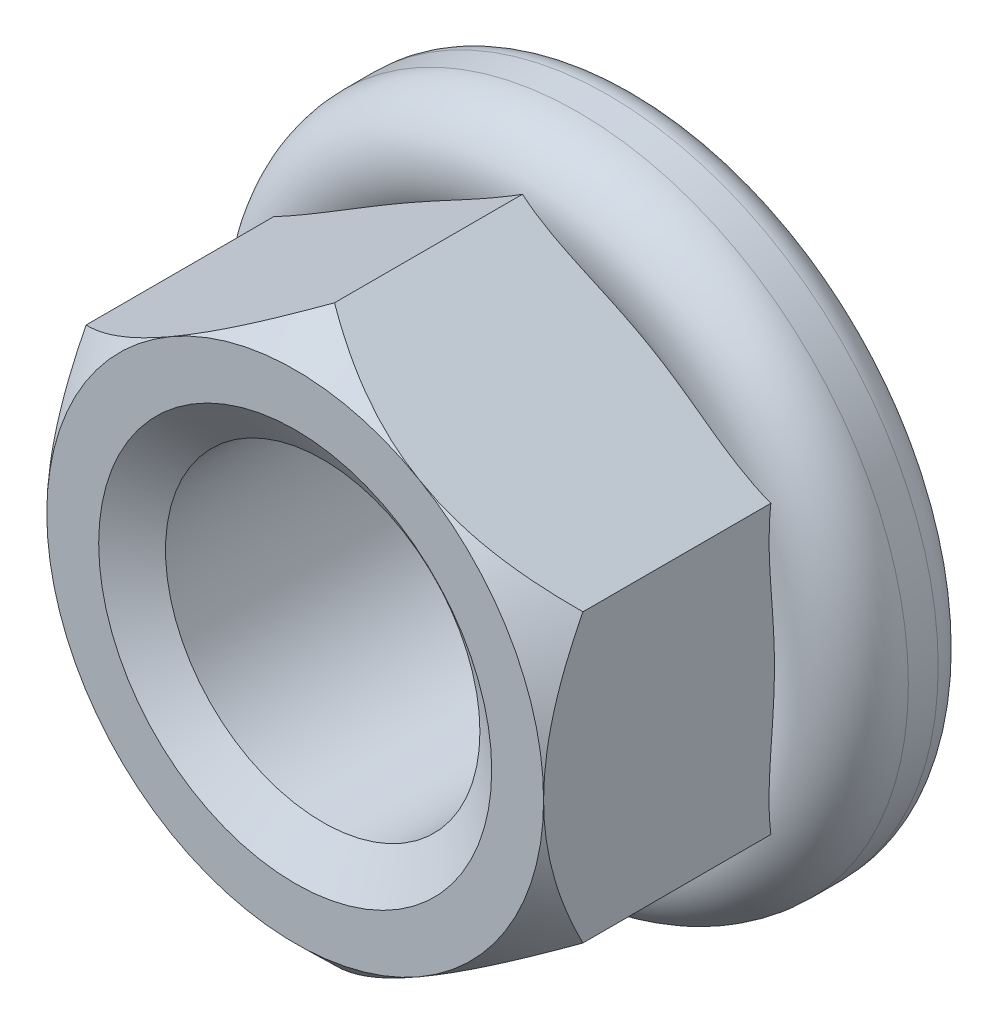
ISO-10303-21;
HEADER;
FILE_DESCRIPTION(('STEP AP214'),'2;1');
FILE_NAME('part.step','',(''),(''),'','','');
FILE_SCHEMA(('AUTOMOTIVE_DESIGN { 1 0 10303 214 1 1 1 1 }'));
ENDSEC;
DATA;
#1=APPLICATION_CONTEXT('core data for automotive mechanical design processes');
#2=APPLICATION_PROTOCOL_DEFINITION('international standard','automotive_design',2000,#1);
#3=PRODUCT_CONTEXT('',#1,'mechanical');
#4=PRODUCT('Part','Part','',(#3));
#5=PRODUCT_RELATED_PRODUCT_CATEGORY('part','',(#4));
#6=PRODUCT_DEFINITION_FORMATION('','',#4);
#7=PRODUCT_DEFINITION_CONTEXT('part definition',#1,'design');
#8=PRODUCT_DEFINITION('design','',#6,#7);
#9=PRODUCT_DEFINITION_SHAPE('','',#8);
#10=(LENGTH_UNIT() NAMED_UNIT(*) SI_UNIT(.MILLI.,.METRE.));
#11=(NAMED_UNIT(*) PLANE_ANGLE_UNIT() SI_UNIT($,.RADIAN.));
#12=(NAMED_UNIT(*) SI_UNIT($,.STERADIAN.) SOLID_ANGLE_UNIT());
#13=UNCERTAINTY_MEASURE_WITH_UNIT(LENGTH_MEASURE(1.E-05),#10,'distance_accuracy_value','');
#14=(GEOMETRIC_REPRESENTATION_CONTEXT(3) GLOBAL_UNCERTAINTY_ASSIGNED_CONTEXT((#13)) GLOBAL_UNIT_ASSIGNED_CONTEXT((#10,
#11,#12)) REPRESENTATION_CONTEXT('',''));
#15=CARTESIAN_POINT('',(0.,0.,0.));
#16=DIRECTION('',(0.,0.,1.));
#17=DIRECTION('',(1.,0.,0.));
#18=AXIS2_PLACEMENT_3D('',#15,#16,#17);
#19=CARTESIAN_POINT('',(0.,4.63404420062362,-5.5626));
#20=DIRECTION('',(-0.500000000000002,0.866025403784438,0.));
#21=DIRECTION('',(-0.866025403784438,-0.500000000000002,0.));
#22=AXIS2_PLACEMENT_3D('',#19,#20,#21);
#23=PLANE('',#22);
#24=DIRECTION('',(0.,0.,1.));
#25=VECTOR('',#24,1.);
#26=CARTESIAN_POINT('',(0.,4.63404420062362,-5.5626));
#27=LINE('',#26,#25);
#28=CARTESIAN_POINT('',(0.,4.63404420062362,-3.67149651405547));
#29=VERTEX_POINT('',#28);
#30=CARTESIAN_POINT('',(0.,4.63404420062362,-0.635));
#31=VERTEX_POINT('',#30);
#32=EDGE_CURVE('E123',#29,#31,#27,.T.);
#33=ORIENTED_EDGE('',*,*,#32,.F.);
#34=CARTESIAN_POINT('',(0.000199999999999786,4.63415967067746,-3.67152592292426));
#35=CARTESIAN_POINT('',(-0.0612952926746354,4.59865534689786,-3.66250534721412));
#36=CARTESIAN_POINT('',(-0.12300925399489,4.56302477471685,-3.65594856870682));
#37=CARTESIAN_POINT('',(-0.246581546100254,4.49168027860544,-3.64684643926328));
#38=CARTESIAN_POINT('',(-0.308439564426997,4.45596653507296,-3.64429561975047));
#39=CARTESIAN_POINT('',(-0.431908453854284,4.38468173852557,-3.64227401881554));
#40=CARTESIAN_POINT('',(-0.49351923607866,4.34911073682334,-3.64278995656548));
#41=CARTESIAN_POINT('',(-0.616713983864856,4.27798421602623,-3.64607852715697));
#42=CARTESIAN_POINT('',(-0.678297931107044,4.2424287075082,-3.64885199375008));
#43=CARTESIAN_POINT('',(-0.862364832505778,4.13615763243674,-3.65939989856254));
#44=CARTESIAN_POINT('',(-0.984739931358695,4.0655043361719,-3.66940670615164));
#45=CARTESIAN_POINT('',(-1.2295695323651,3.92415190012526,-3.68998114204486));
#46=CARTESIAN_POINT('',(-1.35202398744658,3.8534527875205,-3.70054933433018));
#47=CARTESIAN_POINT('',(-1.54205632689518,3.74373756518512,-3.71382785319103));
#48=CARTESIAN_POINT('',(-1.60955369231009,3.70476794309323,-3.71793481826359));
#49=CARTESIAN_POINT('',(-1.74461063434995,3.62679278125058,-3.72439468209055));
#50=CARTESIAN_POINT('',(-1.81217020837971,3.58778724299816,-3.72674765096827));
#51=CARTESIAN_POINT('',(-1.94727775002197,3.50978286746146,-3.7293700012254));
#52=CARTESIAN_POINT('',(-2.01482569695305,3.4707840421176,-3.72964072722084));
#53=CARTESIAN_POINT('',(-2.14990285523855,3.39279720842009,-3.72806613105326));
#54=CARTESIAN_POINT('',(-2.21743206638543,3.35380920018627,-3.72622078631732));
#55=CARTESIAN_POINT('',(-2.35235437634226,3.27591176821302,-3.72067037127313));
#56=CARTESIAN_POINT('',(-2.41974754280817,3.23700230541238,-3.71696739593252));
#57=CARTESIAN_POINT('',(-2.5544693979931,3.15922060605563,-3.70820982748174));
#58=CARTESIAN_POINT('',(-2.62179808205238,3.12034837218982,-3.70315514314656));
#59=CARTESIAN_POINT('',(-2.82380773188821,3.00371804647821,-3.68695297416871));
#60=CARTESIAN_POINT('',(-2.95842426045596,2.92599715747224,-3.67477262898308));
#61=CARTESIAN_POINT('',(-3.16976785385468,2.80397787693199,-3.6587352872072));
#62=CARTESIAN_POINT('',(-3.24641306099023,2.75972674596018,-3.65355452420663));
#63=CARTESIAN_POINT('',(-3.39975018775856,2.67119751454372,-3.64584712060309));
#64=CARTESIAN_POINT('',(-3.47644201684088,2.6269194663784,-3.64331829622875));
#65=CARTESIAN_POINT('',(-3.62993300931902,2.53830140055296,-3.6423739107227));
#66=CARTESIAN_POINT('',(-3.70673220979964,2.49396136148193,-3.64396155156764));
#67=CARTESIAN_POINT('',(-3.82183607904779,2.42750611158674,-3.65067486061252));
#68=CARTESIAN_POINT('',(-3.86023400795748,2.40533705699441,-3.65364074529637));
#69=CARTESIAN_POINT('',(-3.9369198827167,2.36106244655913,-3.66125888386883));
#70=CARTESIAN_POINT('',(-3.97520777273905,2.33895692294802,-3.665911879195));
#71=CARTESIAN_POINT('',(-4.01339999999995,2.31690663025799,-3.67152592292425));
#72=B_SPLINE_CURVE_WITH_KNOTS('',3,(#34,#35,#36,#37,#38,#39,#40,#41,#42,#43,#44,#45,#46,#47,#48,
#49,#50,#51,#52,#53,#54,#55,#56,#57,#58,#59,#60,#61,#62,#63,#64,#65,#66,#67,#68,#69,#70,#71),
.UNSPECIFIED.,.F.,.F.,(4,2,2,2,2,2,2,2,2,2,2,2,2,2,2,2,2,2,4),(0.,0.214609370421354,
0.428925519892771,0.642314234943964,0.855781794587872,1.28072010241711,1.70609369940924,
1.9402188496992,2.17433463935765,2.40829923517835,2.64226632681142,2.87597015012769,
3.10968974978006,3.57743425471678,3.84337423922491,4.1090950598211,4.37502263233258,
4.50830510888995,4.6416462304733),.UNSPECIFIED.);
#73=CARTESIAN_POINT('',(-4.0132,2.31702210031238,-3.67149651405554));
#74=VERTEX_POINT('',#73);
#75=EDGE_CURVE('E114',#29,#74,#72,.T.);
#76=ORIENTED_EDGE('',*,*,#75,.T.);
#77=DIRECTION('',(0.,0.,1.));
#78=VECTOR('',#77,1.);
#79=CARTESIAN_POINT('',(-4.0132,2.3170221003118,-5.5626));
#80=LINE('',#79,#78);
#81=CARTESIAN_POINT('',(-4.0132,2.3170221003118,-0.634999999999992));
#82=VERTEX_POINT('',#81);
#83=EDGE_CURVE('E124',#74,#82,#80,.T.);
#84=ORIENTED_EDGE('',*,*,#83,.T.);
#85=CARTESIAN_POINT('',(-4.0134,2.31690663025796,-0.63511810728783));
#86=CARTESIAN_POINT('',(-3.94571944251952,2.35598201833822,-0.595155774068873));
#87=CARTESIAN_POINT('',(-3.87751240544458,2.39536136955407,-0.556384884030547));
#88=CARTESIAN_POINT('',(-3.73993621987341,2.47479101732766,-0.481587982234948));
#89=CARTESIAN_POINT('',(-3.67056646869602,2.51484166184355,-0.445563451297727));
#90=CARTESIAN_POINT('',(-3.45989113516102,2.63647512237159,-0.341837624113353));
#91=CARTESIAN_POINT('',(-3.3167607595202,2.71911148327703,-0.278931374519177));
#92=CARTESIAN_POINT('',(-3.02799562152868,2.88583011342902,-0.170579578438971));
#93=CARTESIAN_POINT('',(-2.88243410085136,2.96987009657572,-0.124878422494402));
#94=CARTESIAN_POINT('',(-2.58791218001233,3.13991240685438,-0.0535609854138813));
#95=CARTESIAN_POINT('',(-2.43896136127,3.22590920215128,-0.0278939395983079));
#96=CARTESIAN_POINT('',(-2.18364344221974,3.37331707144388,-0.00343450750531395));
#97=CARTESIAN_POINT('',(-2.0776709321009,3.4345003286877,0.00105076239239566));
#98=CARTESIAN_POINT('',(-1.86578488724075,3.55683279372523,-0.00146398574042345));
#99=CARTESIAN_POINT('',(-1.75987138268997,3.61798198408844,-0.0084677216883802));
#100=CARTESIAN_POINT('',(-1.54893866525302,3.73976404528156,-0.033575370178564));
#101=CARTESIAN_POINT('',(-1.44392055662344,3.80039627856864,-0.0516914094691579));
#102=CARTESIAN_POINT('',(-1.23560437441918,3.92066768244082,-0.0980480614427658));
#103=CARTESIAN_POINT('',(-1.13230618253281,3.98030692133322,-0.126287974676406));
#104=CARTESIAN_POINT('',(-0.94067084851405,4.09094763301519,-0.187505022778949));
#105=CARTESIAN_POINT('',(-0.852081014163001,4.14209499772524,-0.219445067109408));
#106=CARTESIAN_POINT('',(-0.676641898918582,4.24338481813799,-0.289182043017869));
#107=CARTESIAN_POINT('',(-0.589792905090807,4.29352710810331,-0.326979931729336));
#108=CARTESIAN_POINT('',(-0.418076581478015,4.39266757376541,-0.407464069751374));
#109=CARTESIAN_POINT('',(-0.333204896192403,4.44166826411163,-0.450138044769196));
#110=CARTESIAN_POINT('',(-0.165222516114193,4.5386529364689,-0.539669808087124));
#111=CARTESIAN_POINT('',(-0.0821102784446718,4.58663780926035,-0.586523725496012));
#112=CARTESIAN_POINT('',(0.000199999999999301,4.63415967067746,-0.635118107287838));
#113=B_SPLINE_CURVE_WITH_KNOTS('',3,(#85,#86,#87,#88,#89,#90,#91,#92,#93,#94,#95,#96,#97,#98,
#99,#100,#101,#102,#103,#104,#105,#106,#107,#108,#109,#110,#111,#112),.UNSPECIFIED.,.F.,.F.,(4,
2,2,2,2,2,2,2,2,2,2,2,2,4),(0.,0.263306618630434,0.526754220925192,1.05653984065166,
1.57811098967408,2.09835619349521,2.46519407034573,2.83215068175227,3.1995084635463,
3.56684086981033,3.88814193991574,4.20949556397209,4.53005737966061,4.85032535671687),.UNSPECIFIED.);
#114=CARTESIAN_POINT('',(-2.00660000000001,3.4755331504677,0.));
#115=VERTEX_POINT('',#114);
#116=EDGE_CURVE('E137',#82,#115,#113,.T.);
#117=ORIENTED_EDGE('',*,*,#116,.T.);
#118=EDGE_CURVE('E65',#115,#31,#113,.T.);
#119=ORIENTED_EDGE('',*,*,#118,.T.);
#120=EDGE_LOOP('',(#33,#76,#84,#117,#119));
#121=FACE_BOUND('',#120,.T.);
#122=ADVANCED_FACE('F39',(#121),#23,.T.);
#123=CARTESIAN_POINT('',(4.0132,2.3170221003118,-5.5626));
#124=DIRECTION('',(0.500000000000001,0.866025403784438,0.));
#125=DIRECTION('',(-0.866025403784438,0.500000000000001,0.));
#126=AXIS2_PLACEMENT_3D('',#123,#124,#125);
#127=PLANE('',#126);
#128=DIRECTION('',(0.,0.,1.));
#129=VECTOR('',#128,1.);
#130=CARTESIAN_POINT('',(4.0132,2.3170221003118,-5.5626));
#131=LINE('',#130,#129);
#132=CARTESIAN_POINT('',(4.0132,2.31702210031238,-3.67149651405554));
#133=VERTEX_POINT('',#132);
#134=CARTESIAN_POINT('',(4.0132,2.31702210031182,-0.635));
#135=VERTEX_POINT('',#134);
#136=EDGE_CURVE('E454',#133,#135,#131,.T.);
#137=ORIENTED_EDGE('',*,*,#136,.F.);
#138=CARTESIAN_POINT('',(4.01339999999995,2.316906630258,-3.67152592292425));
#139=CARTESIAN_POINT('',(3.95190470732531,2.35241095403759,-3.66250534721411));
#140=CARTESIAN_POINT('',(3.89019074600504,2.38804152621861,-3.65594856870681));
#141=CARTESIAN_POINT('',(3.76661845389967,2.45938602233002,-3.64684643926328));
#142=CARTESIAN_POINT('',(3.70476043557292,2.49509976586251,-3.64429561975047));
#143=CARTESIAN_POINT('',(3.58129154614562,2.56638456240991,-3.64227401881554));
#144=CARTESIAN_POINT('',(3.51968076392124,2.60195556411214,-3.64278995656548));
#145=CARTESIAN_POINT('',(3.39648601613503,2.67308208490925,-3.64607852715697));
#146=CARTESIAN_POINT('',(3.33490206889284,2.70863759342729,-3.64885199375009));
#147=CARTESIAN_POINT('',(3.15083516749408,2.81490866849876,-3.65939989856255));
#148=CARTESIAN_POINT('',(3.02846006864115,2.88556196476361,-3.66940670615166));
#149=CARTESIAN_POINT('',(2.78363046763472,3.02691440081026,-3.68998114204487));
#150=CARTESIAN_POINT('',(2.66117601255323,3.09761351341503,-3.70054933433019));
#151=CARTESIAN_POINT('',(2.47114367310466,3.20732873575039,-3.71382785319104));
#152=CARTESIAN_POINT('',(2.40364630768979,3.24629835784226,-3.71793481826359));
#153=CARTESIAN_POINT('',(2.26858936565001,3.32427351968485,-3.72439468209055));
#154=CARTESIAN_POINT('',(2.20102979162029,3.36327905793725,-3.72674765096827));
#155=CARTESIAN_POINT('',(2.06592224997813,3.44128343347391,-3.7293700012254));
#156=CARTESIAN_POINT('',(1.99837430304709,3.48028225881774,-3.72964072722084));
#157=CARTESIAN_POINT('',(1.86329714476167,3.5582690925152,-3.72806613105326));
#158=CARTESIAN_POINT('',(1.79576793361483,3.59725710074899,-3.72622078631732));
#159=CARTESIAN_POINT('',(1.66084562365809,3.6751545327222,-3.72067037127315));
#160=CARTESIAN_POINT('',(1.59345245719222,3.71406399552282,-3.71696739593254));
#161=CARTESIAN_POINT('',(1.45873060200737,3.79184569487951,-3.70820982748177));
#162=CARTESIAN_POINT('',(1.39140191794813,3.8307179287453,-3.7031551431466));
#163=CARTESIAN_POINT('',(1.18939226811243,3.94734825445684,-3.68695297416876));
#164=CARTESIAN_POINT('',(1.05477573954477,4.02506914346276,-3.67477262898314));
#165=CARTESIAN_POINT('',(0.843432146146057,4.14708842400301,-3.65873528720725));
#166=CARTESIAN_POINT('',(0.766786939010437,4.19133955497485,-3.65355452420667));
#167=CARTESIAN_POINT('',(0.613449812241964,4.27986878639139,-3.6458471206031));
#168=CARTESIAN_POINT('',(0.536757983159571,4.32414683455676,-3.64331829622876));
#169=CARTESIAN_POINT('',(0.383266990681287,4.41276490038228,-3.6423739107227));
#170=CARTESIAN_POINT('',(0.306467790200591,4.45710493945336,-3.64396155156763));
#171=CARTESIAN_POINT('',(0.191363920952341,4.5235601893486,-3.65067486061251));
#172=CARTESIAN_POINT('',(0.152965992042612,4.54572924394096,-3.65364074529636));
#173=CARTESIAN_POINT('',(0.0762801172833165,4.59000385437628,-3.66125888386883));
#174=CARTESIAN_POINT('',(0.0379922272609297,4.61210937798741,-3.665911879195));
#175=CARTESIAN_POINT('',(-0.000199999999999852,4.63415967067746,-3.67152592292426));
#176=B_SPLINE_CURVE_WITH_KNOTS('',3,(#138,#139,#140,#141,#142,#143,#144,#145,#146,#147,#148,
#149,#150,#151,#152,#153,#154,#155,#156,#157,#158,#159,#160,#161,#162,#163,#164,#165,#166,#167,
#168,#169,#170,#171,#172,#173,#174,#175),.UNSPECIFIED.,.F.,.F.,(4,2,2,2,2,2,2,2,2,2,2,2,2,2,2,2,
2,2,4),(0.,0.214609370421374,0.428925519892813,0.642314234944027,0.855781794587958,
1.28072010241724,1.70609369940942,1.94021884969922,2.17433463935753,2.40829923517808,
2.642266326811,2.87597015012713,3.10968974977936,3.57743425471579,3.84337423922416,
4.1090950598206,4.37502263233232,4.50830510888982,4.64164623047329),.UNSPECIFIED.);
#177=EDGE_CURVE('E127',#133,#29,#176,.T.);
#178=ORIENTED_EDGE('',*,*,#177,.T.);
#179=ORIENTED_EDGE('',*,*,#32,.T.);
#180=CARTESIAN_POINT('',(-0.000200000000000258,4.63415967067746,-0.635118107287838));
#181=CARTESIAN_POINT('',(0.0674805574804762,4.5950842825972,-0.595155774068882));
#182=CARTESIAN_POINT('',(0.13568759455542,4.55570493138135,-0.556384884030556));
#183=CARTESIAN_POINT('',(0.273263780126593,4.47627528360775,-0.481587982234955));
#184=CARTESIAN_POINT('',(0.342633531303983,4.43622463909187,-0.445563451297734));
#185=CARTESIAN_POINT('',(0.553308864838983,4.31459117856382,-0.341837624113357));
#186=CARTESIAN_POINT('',(0.696439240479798,4.23195481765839,-0.278931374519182));
#187=CARTESIAN_POINT('',(0.985204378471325,4.0652361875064,-0.170579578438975));
#188=CARTESIAN_POINT('',(1.13076589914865,3.98119620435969,-0.124878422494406));
#189=CARTESIAN_POINT('',(1.42528781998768,3.81115389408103,-0.0535609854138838));
#190=CARTESIAN_POINT('',(1.57423863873,3.72515709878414,-0.0278939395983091));
#191=CARTESIAN_POINT('',(1.82955655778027,3.57774922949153,-0.00343450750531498));
#192=CARTESIAN_POINT('',(1.93552906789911,3.51656597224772,0.00105076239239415));
#193=CARTESIAN_POINT('',(2.14741511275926,3.39423350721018,-0.00146398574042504));
#194=CARTESIAN_POINT('',(2.25332861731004,3.33308431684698,-0.00846772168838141));
#195=CARTESIAN_POINT('',(2.46426133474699,3.21130225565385,-0.0335753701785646));
#196=CARTESIAN_POINT('',(2.56927944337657,3.15067002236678,-0.0516914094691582));
#197=CARTESIAN_POINT('',(2.77759562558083,3.03039861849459,-0.0980480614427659));
#198=CARTESIAN_POINT('',(2.88089381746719,2.9707593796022,-0.126287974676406));
#199=CARTESIAN_POINT('',(3.07252915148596,2.86011866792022,-0.187505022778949));
#200=CARTESIAN_POINT('',(3.16111898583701,2.80897130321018,-0.219445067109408));
#201=CARTESIAN_POINT('',(3.33655810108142,2.70768148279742,-0.289182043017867));
#202=CARTESIAN_POINT('',(3.4234070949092,2.65753919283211,-0.326979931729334));
#203=CARTESIAN_POINT('',(3.59512341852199,2.55839872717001,-0.407464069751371));
#204=CARTESIAN_POINT('',(3.6799951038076,2.50939803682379,-0.450138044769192));
#205=CARTESIAN_POINT('',(3.84797748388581,2.41241336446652,-0.539669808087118));
#206=CARTESIAN_POINT('',(3.93108972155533,2.36442849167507,-0.586523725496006));
#207=CARTESIAN_POINT('',(4.0134,2.31690663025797,-0.635118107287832));
#208=B_SPLINE_CURVE_WITH_KNOTS('',3,(#180,#181,#182,#183,#184,#185,#186,#187,#188,#189,#190,
#191,#192,#193,#194,#195,#196,#197,#198,#199,#200,#201,#202,#203,#204,#205,#206,#207),
.UNSPECIFIED.,.F.,.F.,(4,2,2,2,2,2,2,2,2,2,2,2,2,4),(0.,0.263306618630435,0.526754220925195,
1.05653984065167,1.57811098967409,2.09835619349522,2.46519407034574,2.83215068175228,
3.19950846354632,3.56684086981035,3.88814193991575,4.20949556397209,4.53005737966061,
4.85032535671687),.UNSPECIFIED.);
#209=CARTESIAN_POINT('',(2.0066,3.47553315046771,0.));
#210=VERTEX_POINT('',#209);
#211=EDGE_CURVE('E140',#31,#210,#208,.T.);
#212=ORIENTED_EDGE('',*,*,#211,.T.);
#213=EDGE_CURVE('E220',#210,#135,#208,.T.);
#214=ORIENTED_EDGE('',*,*,#213,.T.);
#215=EDGE_LOOP('',(#137,#178,#179,#212,#214));
#216=FACE_BOUND('',#215,.T.);
#217=ADVANCED_FACE('F228',(#216),#127,.T.);
#218=CARTESIAN_POINT('',(4.0132,2.3170221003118,-5.5626));
#219=DIRECTION('',(-1.,0.,0.));
#220=DIRECTION('',(0.,0.,1.));
#221=AXIS2_PLACEMENT_3D('',#218,#219,#220);
#222=PLANE('',#221);
#223=CARTESIAN_POINT('',(4.0132,0.,-3.72929579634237));
#224=CARTESIAN_POINT('',(4.0132,-0.0772595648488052,-3.72930065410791));
#225=CARTESIAN_POINT('',(4.0132,-0.154517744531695,-3.72824845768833));
#226=CARTESIAN_POINT('',(4.0132,-0.308984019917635,-3.72419411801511));
#227=CARTESIAN_POINT('',(4.0132,-0.386192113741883,-3.72119190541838));
#228=CARTESIAN_POINT('',(4.0132,-0.540599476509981,-3.71363091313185));
#229=CARTESIAN_POINT('',(4.0132,-0.617798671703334,-3.70907070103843));
#230=CARTESIAN_POINT('',(4.0132,-0.772136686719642,-3.69900432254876));
#231=CARTESIAN_POINT('',(4.0132,-0.849275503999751,-3.69349811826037));
#232=CARTESIAN_POINT('',(4.0132,-1.08164583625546,-3.67658233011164));
#233=CARTESIAN_POINT('',(4.0132,-1.23684631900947,-3.66484167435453));
#234=CARTESIAN_POINT('',(4.0132,-1.54752594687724,-3.64739212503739));
#235=CARTESIAN_POINT('',(4.0132,-1.70300448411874,-3.64167555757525));
#236=CARTESIAN_POINT('',(4.0132,-1.93721818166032,-3.64357800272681));
#237=CARTESIAN_POINT('',(4.0132,-2.01596536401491,-3.64600860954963));
#238=CARTESIAN_POINT('',(4.0132,-2.17325190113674,-3.65565687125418));
#239=CARTESIAN_POINT('',(4.0132,-2.25179105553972,-3.66287811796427));
#240=CARTESIAN_POINT('',(4.0132,-2.40751207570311,-3.68338447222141));
#241=CARTESIAN_POINT('',(4.0132,-2.484699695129,-3.69662397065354));
#242=CARTESIAN_POINT('',(4.0132,-2.63733979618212,-3.73067996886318));
#243=CARTESIAN_POINT('',(4.0132,-2.71279486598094,-3.75148426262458));
#244=CARTESIAN_POINT('',(4.0132,-2.8398473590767,-3.79533364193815));
#245=CARTESIAN_POINT('',(4.0132,-2.89221568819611,-3.81612511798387));
#246=CARTESIAN_POINT('',(4.0132,-2.99447621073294,-3.86337143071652));
#247=CARTESIAN_POINT('',(4.0132,-3.04436478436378,-3.88983426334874));
#248=CARTESIAN_POINT('',(4.0132,-3.14066624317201,-3.94943108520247));
#249=CARTESIAN_POINT('',(4.0132,-3.1870445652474,-3.98262189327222));
#250=CARTESIAN_POINT('',(4.0132,-3.2737604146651,-4.05614998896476));
#251=CARTESIAN_POINT('',(4.0132,-3.31411080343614,-4.09647164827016));
#252=CARTESIAN_POINT('',(4.0132,-3.37545683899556,-4.17142651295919));
#253=CARTESIAN_POINT('',(4.0132,-3.39865597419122,-4.20425068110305));
#254=CARTESIAN_POINT('',(4.0132,-3.43950732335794,-4.27321560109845));
#255=CARTESIAN_POINT('',(4.0132,-3.45716273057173,-4.30935442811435));
#256=CARTESIAN_POINT('',(4.0132,-3.48587051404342,-4.3845463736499));
#257=CARTESIAN_POINT('',(4.0132,-3.49686762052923,-4.42362093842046));
#258=CARTESIAN_POINT('',(4.0132,-3.51109308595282,-4.50316093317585));
#259=CARTESIAN_POINT('',(4.0132,-3.51432728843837,-4.54362529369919));
#260=CARTESIAN_POINT('',(4.0132,-3.51284573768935,-4.61949172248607));
#261=CARTESIAN_POINT('',(4.0132,-3.50904303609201,-4.65491490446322));
#262=CARTESIAN_POINT('',(4.0132,-3.49550315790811,-4.72460051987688));
#263=CARTESIAN_POINT('',(4.0132,-3.48576535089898,-4.75886282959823));
#264=CARTESIAN_POINT('',(4.0132,-3.46102883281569,-4.82526055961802));
#265=CARTESIAN_POINT('',(4.0132,-3.44604983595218,-4.85740342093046));
#266=CARTESIAN_POINT('',(4.0132,-3.41163063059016,-4.91917421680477));
#267=CARTESIAN_POINT('',(4.0132,-3.39218953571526,-4.94880165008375));
#268=CARTESIAN_POINT('',(4.0132,-3.33917565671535,-5.01919802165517));
#269=CARTESIAN_POINT('',(4.0132,-3.30335588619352,-5.0582775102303));
#270=CARTESIAN_POINT('',(4.0132,-3.22589905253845,-5.13023546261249));
#271=CARTESIAN_POINT('',(4.0132,-3.1842439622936,-5.16309393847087));
#272=CARTESIAN_POINT('',(4.0132,-3.07486265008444,-5.23812591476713));
#273=CARTESIAN_POINT('',(4.0132,-3.00461201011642,-5.27659633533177));
#274=CARTESIAN_POINT('',(4.0132,-2.85932841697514,-5.34230757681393));
#275=CARTESIAN_POINT('',(4.0132,-2.78429802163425,-5.36955434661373));
#276=CARTESIAN_POINT('',(4.0132,-2.63868303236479,-5.41289976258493));
#277=CARTESIAN_POINT('',(4.0132,-2.5683282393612,-5.42979586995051));
#278=CARTESIAN_POINT('',(4.0132,-2.42640859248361,-5.45750015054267));
#279=CARTESIAN_POINT('',(4.0132,-2.35484279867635,-5.46830334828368));
#280=CARTESIAN_POINT('',(4.0132,-2.21066492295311,-5.48503844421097));
#281=CARTESIAN_POINT('',(4.0132,-2.13804902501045,-5.49093585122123));
#282=CARTESIAN_POINT('',(4.0132,-1.99264202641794,-5.49877047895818));
#283=CARTESIAN_POINT('',(4.0132,-1.91985098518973,-5.50070889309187));
#284=CARTESIAN_POINT('',(4.0132,-1.67750915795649,-5.50214851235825));
#285=CARTESIAN_POINT('',(4.0132,-1.50796155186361,-5.49498457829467));
#286=CARTESIAN_POINT('',(4.0132,-1.16914232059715,-5.47452462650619));
#287=CARTESIAN_POINT('',(4.0132,-0.999871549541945,-5.46121897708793));
#288=CARTESIAN_POINT('',(4.0132,-0.745733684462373,-5.44321164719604));
#289=CARTESIAN_POINT('',(4.0132,-0.660951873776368,-5.43753270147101));
#290=CARTESIAN_POINT('',(4.0132,-0.491298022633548,-5.42772012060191));
#291=CARTESIAN_POINT('',(4.0132,-0.40642598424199,-5.42358645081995));
#292=CARTESIAN_POINT('',(4.0132,-0.236732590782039,-5.41753906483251));
#293=CARTESIAN_POINT('',(4.0132,-0.151911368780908,-5.41562183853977));
#294=CARTESIAN_POINT('',(4.0132,0.0177498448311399,-5.41430707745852));
#295=CARTESIAN_POINT('',(4.0132,0.102589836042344,-5.41490949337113));
#296=CARTESIAN_POINT('',(4.0132,0.271690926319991,-5.41852418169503));
#297=CARTESIAN_POINT('',(4.0132,0.355952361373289,-5.42152153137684));
#298=CARTESIAN_POINT('',(4.0132,0.524385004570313,-5.42942735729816));
#299=CARTESIAN_POINT('',(4.0132,0.608556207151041,-5.43433594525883));
#300=CARTESIAN_POINT('',(4.0132,0.777000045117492,-5.4453036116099));
#301=CARTESIAN_POINT('',(4.0132,0.861272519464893,-5.45136509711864));
#302=CARTESIAN_POINT('',(4.0132,1.02980484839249,-5.46365653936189));
#303=CARTESIAN_POINT('',(4.0132,1.11406470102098,-5.4698865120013));
#304=CARTESIAN_POINT('',(4.0132,1.36635739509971,-5.487190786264));
#305=CARTESIAN_POINT('',(4.0132,1.53452936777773,-5.49693577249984));
#306=CARTESIAN_POINT('',(4.0132,1.78683327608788,-5.50172602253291));
#307=CARTESIAN_POINT('',(4.0132,1.87083994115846,-5.50169089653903));
#308=CARTESIAN_POINT('',(4.0132,2.03871088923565,-5.49700167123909));
#309=CARTESIAN_POINT('',(4.0132,2.12257522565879,-5.4923501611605));
#310=CARTESIAN_POINT('',(4.0132,2.25861420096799,-5.47979197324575));
#311=CARTESIAN_POINT('',(4.0132,2.31095850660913,-5.47374284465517));
#312=CARTESIAN_POINT('',(4.0132,2.41529565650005,-5.45879607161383));
#313=CARTESIAN_POINT('',(4.0132,2.46728814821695,-5.44989590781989));
#314=CARTESIAN_POINT('',(4.0132,2.57038445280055,-5.42882367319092));
#315=CARTESIAN_POINT('',(4.0132,2.62149113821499,-5.41666593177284));
#316=CARTESIAN_POINT('',(4.0132,2.72262591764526,-5.38855164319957));
#317=CARTESIAN_POINT('',(4.0132,2.77265465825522,-5.37259744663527));
#318=CARTESIAN_POINT('',(4.0132,2.88524845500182,-5.33111402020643));
#319=CARTESIAN_POINT('',(4.0132,2.94730048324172,-5.30415114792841));
#320=CARTESIAN_POINT('',(4.0132,3.06709501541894,-5.24161551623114));
#321=CARTESIAN_POINT('',(4.0132,3.12483563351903,-5.20603901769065));
#322=CARTESIAN_POINT('',(4.0132,3.2184115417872,-5.13605312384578));
#323=CARTESIAN_POINT('',(4.0132,3.2559464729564,-5.10393282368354));
#324=CARTESIAN_POINT('',(4.0132,3.32553067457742,-5.03422973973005));
#325=CARTESIAN_POINT('',(4.0132,3.35759131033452,-4.99665858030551));
#326=CARTESIAN_POINT('',(4.0132,3.40837906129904,-4.92459280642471));
#327=CARTESIAN_POINT('',(4.0132,3.42849247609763,-4.89108036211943));
#328=CARTESIAN_POINT('',(4.0132,3.46294795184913,-4.82117869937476));
#329=CARTESIAN_POINT('',(4.0132,3.47729225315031,-4.78479060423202));
#330=CARTESIAN_POINT('',(4.0132,3.49927676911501,-4.70974677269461));
#331=CARTESIAN_POINT('',(4.0132,3.5068714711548,-4.67107748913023));
#332=CARTESIAN_POINT('',(4.0132,3.51454479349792,-4.5930024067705));
#333=CARTESIAN_POINT('',(4.0132,3.51462729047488,-4.55359699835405));
#334=CARTESIAN_POINT('',(4.0132,3.50769054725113,-4.47979318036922));
#335=CARTESIAN_POINT('',(4.0132,3.50144696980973,-4.44531848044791));
#336=CARTESIAN_POINT('',(4.0132,3.48343682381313,-4.37785585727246));
#337=CARTESIAN_POINT('',(4.0132,3.47166965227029,-4.34486809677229));
#338=CARTESIAN_POINT('',(4.0132,3.44282430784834,-4.28000161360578));
#339=CARTESIAN_POINT('',(4.0132,3.42558198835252,-4.24819664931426));
#340=CARTESIAN_POINT('',(4.0132,3.38680772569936,-4.18734115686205));
#341=CARTESIAN_POINT('',(4.0132,3.3652736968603,-4.15829197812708));
#342=CARTESIAN_POINT('',(4.0132,3.30587997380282,-4.08786429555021));
#343=CARTESIAN_POINT('',(4.0132,3.26557479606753,-4.04854406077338));
#344=CARTESIAN_POINT('',(4.0132,3.17922816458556,-3.97680062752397));
#345=CARTESIAN_POINT('',(4.0132,3.13317201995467,-3.94439569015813));
#346=CARTESIAN_POINT('',(4.0132,3.0112005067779,-3.87000493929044));
#347=CARTESIAN_POINT('',(4.0132,2.93264958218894,-3.8323692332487));
#348=CARTESIAN_POINT('',(4.0132,2.77093023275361,-3.76937230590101));
#349=CARTESIAN_POINT('',(4.0132,2.68775589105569,-3.74402723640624));
#350=CARTESIAN_POINT('',(4.0132,2.50332879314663,-3.69920358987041));
#351=CARTESIAN_POINT('',(4.0132,2.40160766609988,-3.68171277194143));
#352=CARTESIAN_POINT('',(4.0132,2.19687939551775,-3.65685936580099));
#353=CARTESIAN_POINT('',(4.0132,2.09387020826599,-3.64951571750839));
#354=CARTESIAN_POINT('',(4.0132,1.88702669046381,-3.64206895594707));
#355=CARTESIAN_POINT('',(4.0132,1.78319111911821,-3.64200958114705));
#356=CARTESIAN_POINT('',(4.0132,1.57560980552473,-3.64670469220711));
#357=CARTESIAN_POINT('',(4.0132,1.47186414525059,-3.65146185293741));
#358=CARTESIAN_POINT('',(4.0132,1.25376937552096,-3.66413980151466));
#359=CARTESIAN_POINT('',(4.0132,1.13943832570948,-3.67233789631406));
#360=CARTESIAN_POINT('',(4.0132,0.910828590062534,-3.68901153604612));
#361=CARTESIAN_POINT('',(4.0132,0.796549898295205,-3.69748701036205));
#362=CARTESIAN_POINT('',(4.0132,0.568612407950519,-3.71219592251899));
#363=CARTESIAN_POINT('',(4.0132,0.454954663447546,-3.7184441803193));
#364=CARTESIAN_POINT('',(4.0132,0.227530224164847,-3.72698957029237));
#365=CARTESIAN_POINT('',(4.0132,0.113763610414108,-3.72928864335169));
#366=CARTESIAN_POINT('',(4.0132,0.,-3.72929579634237));
#367=B_SPLINE_CURVE_WITH_KNOTS('',3,(#223,#224,#225,#226,#227,#228,#229,#230,#231,#232,#233,
#234,#235,#236,#237,#238,#239,#240,#241,#242,#243,#244,#245,#246,#247,#248,#249,#250,#251,#252,
#253,#254,#255,#256,#257,#258,#259,#260,#261,#262,#263,#264,#265,#266,#267,#268,#269,#270,#271,
#272,#273,#274,#275,#276,#277,#278,#279,#280,#281,#282,#283,#284,#285,#286,#287,#288,#289,#290,
#291,#292,#293,#294,#295,#296,#297,#298,#299,#300,#301,#302,#303,#304,#305,#306,#307,#308,#309,
#310,#311,#312,#313,#314,#315,#316,#317,#318,#319,#320,#321,#322,#323,#324,#325,#326,#327,#328,
#329,#330,#331,#332,#333,#334,#335,#336,#337,#338,#339,#340,#341,#342,#343,#344,#345,#346,#347,
#348,#349,#350,#351,#352,#353,#354,#355,#356,#357,#358,#359,#360,#361,#362,#363,#364,#365,#366),
.UNSPECIFIED.,.T.,.F.,(4,2,2,2,2,2,2,2,2,2,2,2,2,2,2,2,2,2,2,2,2,2,2,2,2,2,2,2,2,2,2,2,2,2,2,2,
2,2,2,2,2,2,2,2,2,2,2,2,2,2,2,2,2,2,2,2,2,2,2,2,2,2,2,2,2,2,2,2,2,2,2,4),(0.,0.231769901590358,
0.463548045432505,0.69553985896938,0.92754096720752,1.39450421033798,1.86087188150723,
2.09711603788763,2.33353752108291,2.56819641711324,2.80247835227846,2.97124350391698,
3.14024817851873,3.31074450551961,3.48087169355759,3.60101738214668,3.72109373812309,
3.84215363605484,3.9631223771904,4.06947990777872,4.17584873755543,4.2818216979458,
4.38781572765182,4.54595490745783,4.70459386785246,4.94352752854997,5.18233438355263,
5.39907544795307,5.61599324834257,5.8344235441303,6.05278798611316,6.56142729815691,
7.07086700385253,7.3257704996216,7.58066828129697,7.83516183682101,8.08965041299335,
8.34256553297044,8.59549543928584,8.84895934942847,9.10244727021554,9.60753672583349,
9.85946880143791,10.1112596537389,10.2692744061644,10.4274291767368,10.5848993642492,
10.7422723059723,10.944715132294,11.1472459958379,11.2949737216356,11.4423909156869,
11.559185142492,11.6759339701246,11.7934641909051,11.9109337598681,12.0155568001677,
12.1201912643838,12.2283178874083,12.3364971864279,12.5044607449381,12.6728624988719,
12.9326929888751,13.1928640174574,13.5017621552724,13.8112360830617,14.1225681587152,
14.4340732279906,14.7779380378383,15.1217159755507,15.463161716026,15.8044395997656),.UNSPECIFIED.);
#368=CARTESIAN_POINT('',(4.0132,-2.31702210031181,-3.67149651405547));
#369=VERTEX_POINT('',#368);
#370=EDGE_CURVE('E241',#133,#369,#367,.T.);
#371=ORIENTED_EDGE('',*,*,#370,.F.);
#372=ORIENTED_EDGE('',*,*,#136,.T.);
#373=CARTESIAN_POINT('',(4.0132,-4.79633561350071,-2.29173633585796));
#374=CARTESIAN_POINT('',(4.0132,-4.68124861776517,-2.20147897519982));
#375=CARTESIAN_POINT('',(4.0132,-4.56552468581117,-2.11202105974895));
#376=CARTESIAN_POINT('',(4.0132,-4.33254409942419,-1.93506760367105));
#377=CARTESIAN_POINT('',(4.0132,-4.21528708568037,-1.84757253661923));
#378=CARTESIAN_POINT('',(4.0132,-3.978112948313,-1.67427712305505));
#379=CARTESIAN_POINT('',(4.0132,-3.858182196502,-1.5884953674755));
#380=CARTESIAN_POINT('',(4.0132,-3.61627499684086,-1.41987653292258));
#381=CARTESIAN_POINT('',(4.0132,-3.49429869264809,-1.33703924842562));
#382=CARTESIAN_POINT('',(4.0132,-3.23997668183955,-1.16972921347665));
#383=CARTESIAN_POINT('',(4.0132,-3.10747114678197,-1.08549819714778));
#384=CARTESIAN_POINT('',(4.0132,-2.83926859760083,-0.922193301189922));
#385=CARTESIAN_POINT('',(4.0132,-2.70357103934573,-0.843120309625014));
#386=CARTESIAN_POINT('',(4.0132,-2.42893920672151,-0.691803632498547));
#387=CARTESIAN_POINT('',(4.0132,-2.29001624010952,-0.619539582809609));
#388=CARTESIAN_POINT('',(4.0132,-2.00813445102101,-0.483438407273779));
#389=CARTESIAN_POINT('',(4.0132,-1.86517761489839,-0.419597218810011));
#390=CARTESIAN_POINT('',(4.0132,-1.59086042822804,-0.309072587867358));
#391=CARTESIAN_POINT('',(4.0132,-1.45995361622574,-0.261274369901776));
#392=CARTESIAN_POINT('',(4.0132,-1.19472993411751,-0.176094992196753));
#393=CARTESIAN_POINT('',(4.0132,-1.06041280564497,-0.138714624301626));
#394=CARTESIAN_POINT('',(4.0132,-0.791493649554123,-0.0769652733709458));
#395=CARTESIAN_POINT('',(4.0132,-0.656946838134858,-0.0523597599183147));
#396=CARTESIAN_POINT('',(4.0132,-0.386062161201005,-0.0166633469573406));
#397=CARTESIAN_POINT('',(4.0132,-0.249724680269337,-0.00556959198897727));
#398=CARTESIAN_POINT('',(4.0132,0.0179718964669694,0.00215005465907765));
#399=CARTESIAN_POINT('',(4.0132,0.149314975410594,-0.000670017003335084));
#400=CARTESIAN_POINT('',(4.0132,0.411068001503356,-0.0193139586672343));
#401=CARTESIAN_POINT('',(4.0132,0.541477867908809,-0.0351389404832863));
#402=CARTESIAN_POINT('',(4.0132,0.802555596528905,-0.0791610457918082));
#403=CARTESIAN_POINT('',(4.0132,0.933186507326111,-0.107573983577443));
#404=CARTESIAN_POINT('',(4.0132,1.19155656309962,-0.175198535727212));
#405=CARTESIAN_POINT('',(4.0132,1.31929582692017,-0.214409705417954));
#406=CARTESIAN_POINT('',(4.0132,1.70054816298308,-0.346524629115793));
#407=CARTESIAN_POINT('',(4.0132,1.94925046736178,-0.453360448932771));
#408=CARTESIAN_POINT('',(4.0132,2.31332450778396,-0.631857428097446));
#409=CARTESIAN_POINT('',(4.0132,2.43339820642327,-0.694528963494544));
#410=CARTESIAN_POINT('',(4.0132,2.67082819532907,-0.824840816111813));
#411=CARTESIAN_POINT('',(4.0132,2.78818486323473,-0.892480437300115));
#412=CARTESIAN_POINT('',(4.0132,3.01509094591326,-1.0285434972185));
#413=CARTESIAN_POINT('',(4.0132,3.12475025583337,-1.09678563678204));
#414=CARTESIAN_POINT('',(4.0132,3.34214149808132,-1.23628725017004));
#415=CARTESIAN_POINT('',(4.0132,3.44987328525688,-1.30754694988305));
#416=CARTESIAN_POINT('',(4.0132,3.66281141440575,-1.45199965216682));
#417=CARTESIAN_POINT('',(4.0132,3.76803084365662,-1.52517344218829));
#418=CARTESIAN_POINT('',(4.0132,3.97696909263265,-1.67357378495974));
#419=CARTESIAN_POINT('',(4.0132,4.08068832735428,-1.74879975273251));
#420=CARTESIAN_POINT('',(4.0132,4.18377311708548,-1.82487119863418));
#421=B_SPLINE_CURVE_WITH_KNOTS('',3,(#373,#374,#375,#376,#377,#378,#379,#380,#381,#382,#383,
#384,#385,#386,#387,#388,#389,#390,#391,#392,#393,#394,#395,#396,#397,#398,#399,#400,#401,#402,
#403,#404,#405,#406,#407,#408,#409,#410,#411,#412,#413,#414,#415,#416,#417,#418,#419,#420),
.UNSPECIFIED.,.F.,.F.,(4,2,2,2,2,2,2,2,2,2,2,2,2,2,2,2,2,2,2,2,2,2,2,4),(0.,0.438782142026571,
0.877669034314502,1.31998625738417,1.76227254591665,2.23321292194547,2.70423416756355,
3.17379872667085,3.64313596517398,4.06086090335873,4.47861758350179,4.88833558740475,
5.29796698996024,5.691422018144,6.08491068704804,6.48542358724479,6.88591999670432,
7.69551641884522,8.10181003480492,8.5080468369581,8.89547429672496,9.28293080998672,
9.66739098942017,10.0517426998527),.UNSPECIFIED.);
#422=CARTESIAN_POINT('',(4.0132,0.,0.));
#423=VERTEX_POINT('',#422);
#424=EDGE_CURVE('E217',#423,#135,#421,.T.);
#425=ORIENTED_EDGE('',*,*,#424,.F.);
#426=CARTESIAN_POINT('',(4.0132,-2.31702210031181,-0.635));
#427=VERTEX_POINT('',#426);
#428=EDGE_CURVE('E207',#427,#423,#421,.T.);
#429=ORIENTED_EDGE('',*,*,#428,.F.);
#430=DIRECTION('',(0.,0.,1.));
#431=VECTOR('',#430,1.);
#432=CARTESIAN_POINT('',(4.0132,-2.31702210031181,-5.5626));
#433=LINE('',#432,#431);
#434=EDGE_CURVE('E452',#369,#427,#433,.T.);
#435=ORIENTED_EDGE('',*,*,#434,.F.);
#436=EDGE_LOOP('',(#371,#372,#425,#429,#435));
#437=FACE_BOUND('',#436,.T.);
#438=ADVANCED_FACE('F229',(#437),#222,.F.);
#439=CARTESIAN_POINT('',(0.,-4.63404420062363,-5.5626));
#440=DIRECTION('',(0.500000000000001,-0.866025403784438,0.));
#441=DIRECTION('',(0.866025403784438,0.500000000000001,0.));
#442=AXIS2_PLACEMENT_3D('',#439,#440,#441);
#443=PLANE('',#442);
#444=DIRECTION('',(0.,0.,1.));
#445=VECTOR('',#444,1.);
#446=CARTESIAN_POINT('',(0.,-4.63404420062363,-5.5626));
#447=LINE('',#446,#445);
#448=CARTESIAN_POINT('',(0.,-4.63404420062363,-3.67149651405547));
#449=VERTEX_POINT('',#448);
#450=CARTESIAN_POINT('',(0.,-4.63404420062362,-0.635));
#451=VERTEX_POINT('',#450);
#452=EDGE_CURVE('E131',#449,#451,#447,.T.);
#453=ORIENTED_EDGE('',*,*,#452,.F.);
#454=CARTESIAN_POINT('',(-0.000199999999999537,-4.63415967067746,-3.67152592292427));
#455=CARTESIAN_POINT('',(0.0612952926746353,-4.59865534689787,-3.66250534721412));
#456=CARTESIAN_POINT('',(0.123009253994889,-4.56302477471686,-3.65594856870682));
#457=CARTESIAN_POINT('',(0.246581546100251,-4.49168027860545,-3.64684643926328));
#458=CARTESIAN_POINT('',(0.308439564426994,-4.45596653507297,-3.64429561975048));
#459=CARTESIAN_POINT('',(0.431908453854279,-4.38468173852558,-3.64227401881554));
#460=CARTESIAN_POINT('',(0.493519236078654,-4.34911073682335,-3.64278995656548));
#461=CARTESIAN_POINT('',(0.616713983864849,-4.27798421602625,-3.64607852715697));
#462=CARTESIAN_POINT('',(0.678297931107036,-4.24242870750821,-3.64885199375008));
#463=CARTESIAN_POINT('',(0.862364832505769,-4.13615763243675,-3.65939989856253));
#464=CARTESIAN_POINT('',(0.984739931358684,-4.06550433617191,-3.66940670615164));
#465=CARTESIAN_POINT('',(1.22956953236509,-3.92415190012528,-3.68998114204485));
#466=CARTESIAN_POINT('',(1.35202398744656,-3.85345278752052,-3.70054933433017));
#467=CARTESIAN_POINT('',(1.54205632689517,-3.74373756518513,-3.71382785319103));
#468=CARTESIAN_POINT('',(1.60955369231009,-3.70476794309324,-3.71793481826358));
#469=CARTESIAN_POINT('',(1.74461063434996,-3.62679278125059,-3.72439468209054));
#470=CARTESIAN_POINT('',(1.81217020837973,-3.58778724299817,-3.72674765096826));
#471=CARTESIAN_POINT('',(1.94727775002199,-3.50978286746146,-3.7293700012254));
#472=CARTESIAN_POINT('',(2.01482569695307,-3.47078404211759,-3.72964072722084));
#473=CARTESIAN_POINT('',(2.14990285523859,-3.39279720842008,-3.72806613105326));
#474=CARTESIAN_POINT('',(2.21743206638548,-3.35380920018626,-3.72622078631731));
#475=CARTESIAN_POINT('',(2.35235437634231,-3.27591176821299,-3.72067037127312));
#476=CARTESIAN_POINT('',(2.41974754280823,-3.23700230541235,-3.71696739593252));
#477=CARTESIAN_POINT('',(2.55446939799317,-3.1592206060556,-3.70820982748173));
#478=CARTESIAN_POINT('',(2.62179808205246,-3.12034837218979,-3.70315514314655));
#479=CARTESIAN_POINT('',(2.8238077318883,-3.00371804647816,-3.6869529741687));
#480=CARTESIAN_POINT('',(2.95842426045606,-2.92599715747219,-3.67477262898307));
#481=CARTESIAN_POINT('',(3.16976785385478,-2.80397787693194,-3.65873528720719));
#482=CARTESIAN_POINT('',(3.24641306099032,-2.75972674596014,-3.65355452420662));
#483=CARTESIAN_POINT('',(3.39975018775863,-2.67119751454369,-3.64584712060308));
#484=CARTESIAN_POINT('',(3.47644201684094,-2.62691946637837,-3.64331829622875));
#485=CARTESIAN_POINT('',(3.62993300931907,-2.53830140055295,-3.6423739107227));
#486=CARTESIAN_POINT('',(3.70673220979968,-2.49396136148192,-3.64396155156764));
#487=CARTESIAN_POINT('',(3.82183607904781,-2.42750611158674,-3.65067486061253));
#488=CARTESIAN_POINT('',(3.8602340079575,-2.40533705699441,-3.65364074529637));
#489=CARTESIAN_POINT('',(3.93691988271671,-2.36106244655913,-3.66125888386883));
#490=CARTESIAN_POINT('',(3.97520777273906,-2.33895692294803,-3.665911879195));
#491=CARTESIAN_POINT('',(4.01339999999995,-2.316906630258,-3.67152592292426));
#492=B_SPLINE_CURVE_WITH_KNOTS('',3,(#454,#455,#456,#457,#458,#459,#460,#461,#462,#463,#464,
#465,#466,#467,#468,#469,#470,#471,#472,#473,#474,#475,#476,#477,#478,#479,#480,#481,#482,#483,
#484,#485,#486,#487,#488,#489,#490,#491),.UNSPECIFIED.,.F.,.F.,(4,2,2,2,2,2,2,2,2,2,2,2,2,2,2,2,
2,2,4),(0.,0.214609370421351,0.428925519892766,0.642314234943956,0.855781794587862,
1.2807201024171,1.70609369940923,1.9402188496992,2.17433463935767,2.40829923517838,
2.64226632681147,2.87597015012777,3.10968974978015,3.57743425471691,3.843374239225,
4.10909505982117,4.3750226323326,4.50830510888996,4.64164623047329),.UNSPECIFIED.);
#493=EDGE_CURVE('E266',#449,#369,#492,.T.);
#494=ORIENTED_EDGE('',*,*,#493,.T.);
#495=ORIENTED_EDGE('',*,*,#434,.T.);
#496=CARTESIAN_POINT('',(4.0134,-2.31690663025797,-0.635118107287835));
#497=CARTESIAN_POINT('',(3.94571944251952,-2.35598201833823,-0.595155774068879));
#498=CARTESIAN_POINT('',(3.87751240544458,-2.39536136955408,-0.556384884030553));
#499=CARTESIAN_POINT('',(3.73993621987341,-2.47479101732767,-0.481587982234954));
#500=CARTESIAN_POINT('',(3.67056646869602,-2.51484166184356,-0.445563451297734));
#501=CARTESIAN_POINT('',(3.45989113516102,-2.6364751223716,-0.341837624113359));
#502=CARTESIAN_POINT('',(3.31676075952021,-2.71911148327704,-0.278931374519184));
#503=CARTESIAN_POINT('',(3.02799562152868,-2.88583011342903,-0.170579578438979));
#504=CARTESIAN_POINT('',(2.88243410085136,-2.96987009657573,-0.12487842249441));
#505=CARTESIAN_POINT('',(2.58791218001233,-3.13991240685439,-0.0535609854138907));
#506=CARTESIAN_POINT('',(2.43896136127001,-3.22590920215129,-0.0278939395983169));
#507=CARTESIAN_POINT('',(2.18364344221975,-3.37331707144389,-0.00343450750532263));
#508=CARTESIAN_POINT('',(2.0776709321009,-3.4345003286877,0.00105076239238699));
#509=CARTESIAN_POINT('',(1.86578488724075,-3.55683279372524,-0.00146398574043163));
#510=CARTESIAN_POINT('',(1.75987138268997,-3.61798198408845,-0.00846772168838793));
#511=CARTESIAN_POINT('',(1.54893866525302,-3.73976404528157,-0.033575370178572));
#512=CARTESIAN_POINT('',(1.44392055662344,-3.80039627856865,-0.0516914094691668));
#513=CARTESIAN_POINT('',(1.23560437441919,-3.92066768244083,-0.0980480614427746));
#514=CARTESIAN_POINT('',(1.13230618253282,-3.98030692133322,-0.126287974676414));
#515=CARTESIAN_POINT('',(0.940670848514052,-4.0909476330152,-0.187505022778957));
#516=CARTESIAN_POINT('',(0.852081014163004,-4.14209499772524,-0.219445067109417));
#517=CARTESIAN_POINT('',(0.676641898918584,-4.243384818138,-0.289182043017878));
#518=CARTESIAN_POINT('',(0.589792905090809,-4.29352710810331,-0.326979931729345));
#519=CARTESIAN_POINT('',(0.418076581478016,-4.39266757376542,-0.407464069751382));
#520=CARTESIAN_POINT('',(0.333204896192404,-4.44166826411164,-0.450138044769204));
#521=CARTESIAN_POINT('',(0.165222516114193,-4.53865293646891,-0.539669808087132));
#522=CARTESIAN_POINT('',(0.0821102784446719,-4.58663780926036,-0.586523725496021));
#523=CARTESIAN_POINT('',(-0.00019999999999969,-4.63415967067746,-0.635118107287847));
#524=B_SPLINE_CURVE_WITH_KNOTS('',3,(#496,#497,#498,#499,#500,#501,#502,#503,#504,#505,#506,
#507,#508,#509,#510,#511,#512,#513,#514,#515,#516,#517,#518,#519,#520,#521,#522,#523),
.UNSPECIFIED.,.F.,.F.,(4,2,2,2,2,2,2,2,2,2,2,2,2,4),(0.,0.263306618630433,0.52675422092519,
1.05653984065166,1.57811098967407,2.0983561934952,2.46519407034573,2.83215068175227,
3.1995084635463,3.56684086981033,3.88814193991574,4.20949556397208,4.53005737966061,
4.85032535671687),.UNSPECIFIED.);
#525=CARTESIAN_POINT('',(2.00660000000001,-3.47553315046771,0.));
#526=VERTEX_POINT('',#525);
#527=EDGE_CURVE('E473',#427,#526,#524,.T.);
#528=ORIENTED_EDGE('',*,*,#527,.T.);
#529=EDGE_CURVE('E199',#526,#451,#524,.T.);
#530=ORIENTED_EDGE('',*,*,#529,.T.);
#531=EDGE_LOOP('',(#453,#494,#495,#528,#530));
#532=FACE_BOUND('',#531,.T.);
#533=ADVANCED_FACE('F275',(#532),#443,.T.);
#534=CARTESIAN_POINT('',(-4.0132,-2.31702210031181,-5.5626));
#535=DIRECTION('',(-0.500000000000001,-0.866025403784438,0.));
#536=DIRECTION('',(0.866025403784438,-0.500000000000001,0.));
#537=AXIS2_PLACEMENT_3D('',#534,#535,#536);
#538=PLANE('',#537);
#539=DIRECTION('',(0.,0.,1.));
#540=VECTOR('',#539,1.);
#541=CARTESIAN_POINT('',(-4.0132,-2.31702210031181,-5.5626));
#542=LINE('',#541,#540);
#543=CARTESIAN_POINT('',(-4.0132,-2.31702210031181,-3.67149651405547));
#544=VERTEX_POINT('',#543);
#545=CARTESIAN_POINT('',(-4.0132,-2.31702210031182,-0.635));
#546=VERTEX_POINT('',#545);
#547=EDGE_CURVE('E133',#544,#546,#542,.T.);
#548=ORIENTED_EDGE('',*,*,#547,.F.);
#549=CARTESIAN_POINT('',(-4.01339999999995,-2.31690663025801,-3.67152592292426));
#550=CARTESIAN_POINT('',(-3.95190470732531,-2.35241095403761,-3.66250534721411));
#551=CARTESIAN_POINT('',(-3.89019074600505,-2.38804152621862,-3.65594856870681));
#552=CARTESIAN_POINT('',(-3.76661845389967,-2.45938602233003,-3.64684643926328));
#553=CARTESIAN_POINT('',(-3.70476043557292,-2.49509976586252,-3.64429561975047));
#554=CARTESIAN_POINT('',(-3.58129154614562,-2.56638456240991,-3.64227401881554));
#555=CARTESIAN_POINT('',(-3.51968076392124,-2.60195556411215,-3.64278995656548));
#556=CARTESIAN_POINT('',(-3.39648601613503,-2.67308208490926,-3.64607852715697));
#557=CARTESIAN_POINT('',(-3.33490206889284,-2.7086375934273,-3.64885199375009));
#558=CARTESIAN_POINT('',(-3.15083516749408,-2.81490866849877,-3.65939989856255));
#559=CARTESIAN_POINT('',(-3.02846006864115,-2.88556196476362,-3.66940670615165));
#560=CARTESIAN_POINT('',(-2.78363046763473,-3.02691440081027,-3.68998114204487));
#561=CARTESIAN_POINT('',(-2.66117601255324,-3.09761351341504,-3.70054933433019));
#562=CARTESIAN_POINT('',(-2.47114367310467,-3.2073287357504,-3.71382785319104));
#563=CARTESIAN_POINT('',(-2.40364630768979,-3.24629835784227,-3.71793481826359));
#564=CARTESIAN_POINT('',(-2.26858936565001,-3.32427351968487,-3.72439468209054));
#565=CARTESIAN_POINT('',(-2.20102979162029,-3.36327905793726,-3.72674765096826));
#566=CARTESIAN_POINT('',(-2.06592224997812,-3.44128343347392,-3.7293700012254));
#567=CARTESIAN_POINT('',(-1.99837430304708,-3.48028225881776,-3.72964072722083));
#568=CARTESIAN_POINT('',(-1.86329714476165,-3.55826909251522,-3.72806613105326));
#569=CARTESIAN_POINT('',(-1.79576793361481,-3.59725710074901,-3.72622078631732));
#570=CARTESIAN_POINT('',(-1.66084562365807,-3.67515453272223,-3.72067037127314));
#571=CARTESIAN_POINT('',(-1.59345245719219,-3.71406399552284,-3.71696739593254));
#572=CARTESIAN_POINT('',(-1.45873060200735,-3.79184569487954,-3.70820982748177));
#573=CARTESIAN_POINT('',(-1.3914019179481,-3.83071792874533,-3.70315514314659));
#574=CARTESIAN_POINT('',(-1.1893922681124,-3.94734825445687,-3.68695297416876));
#575=CARTESIAN_POINT('',(-1.05477573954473,-4.02506914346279,-3.67477262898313));
#576=CARTESIAN_POINT('',(-0.843432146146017,-4.14708842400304,-3.65873528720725));
#577=CARTESIAN_POINT('',(-0.7667869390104,-4.19133955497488,-3.65355452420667));
#578=CARTESIAN_POINT('',(-0.613449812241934,-4.27986878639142,-3.6458471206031));
#579=CARTESIAN_POINT('',(-0.536757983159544,-4.32414683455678,-3.64331829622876));
#580=CARTESIAN_POINT('',(-0.383266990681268,-4.4127649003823,-3.6423739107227));
#581=CARTESIAN_POINT('',(-0.306467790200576,-4.45710493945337,-3.64396155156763));
#582=CARTESIAN_POINT('',(-0.191363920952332,-4.52356018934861,-3.65067486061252));
#583=CARTESIAN_POINT('',(-0.152965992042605,-4.54572924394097,-3.65364074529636));
#584=CARTESIAN_POINT('',(-0.0762801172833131,-4.59000385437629,-3.66125888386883));
#585=CARTESIAN_POINT('',(-0.0379922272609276,-4.61210937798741,-3.665911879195));
#586=CARTESIAN_POINT('',(0.000200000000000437,-4.63415967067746,-3.67152592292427));
#587=B_SPLINE_CURVE_WITH_KNOTS('',3,(#549,#550,#551,#552,#553,#554,#555,#556,#557,#558,#559,
#560,#561,#562,#563,#564,#565,#566,#567,#568,#569,#570,#571,#572,#573,#574,#575,#576,#577,#578,
#579,#580,#581,#582,#583,#584,#585,#586),.UNSPECIFIED.,.F.,.F.,(4,2,2,2,2,2,2,2,2,2,2,2,2,2,2,2,
2,2,4),(0.,0.214609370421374,0.428925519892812,0.642314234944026,0.855781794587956,
1.28072010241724,1.70609369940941,1.94021884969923,2.17433463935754,2.40829923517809,
2.64226632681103,2.87597015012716,3.10968974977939,3.57743425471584,3.84337423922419,
4.10909505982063,4.37502263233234,4.50830510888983,4.64164623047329),.UNSPECIFIED.);
#588=EDGE_CURVE('E59',#544,#449,#587,.T.);
#589=ORIENTED_EDGE('',*,*,#588,.T.);
#590=ORIENTED_EDGE('',*,*,#452,.T.);
#591=CARTESIAN_POINT('',(0.000200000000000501,-4.63415967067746,-0.635118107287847));
#592=CARTESIAN_POINT('',(-0.0674805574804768,-4.59508428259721,-0.59515577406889));
#593=CARTESIAN_POINT('',(-0.135687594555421,-4.55570493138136,-0.556384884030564));
#594=CARTESIAN_POINT('',(-0.273263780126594,-4.47627528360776,-0.481587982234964));
#595=CARTESIAN_POINT('',(-0.342633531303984,-4.43622463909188,-0.445563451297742));
#596=CARTESIAN_POINT('',(-0.553308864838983,-4.31459117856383,-0.341837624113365));
#597=CARTESIAN_POINT('',(-0.6964392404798,-4.23195481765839,-0.27893137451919));
#598=CARTESIAN_POINT('',(-0.985204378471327,-4.06523618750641,-0.170579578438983));
#599=CARTESIAN_POINT('',(-1.13076589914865,-3.9811962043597,-0.124878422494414));
#600=CARTESIAN_POINT('',(-1.42528781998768,-3.81115389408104,-0.053560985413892));
#601=CARTESIAN_POINT('',(-1.57423863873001,-3.72515709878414,-0.0278939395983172));
#602=CARTESIAN_POINT('',(-1.82955655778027,-3.57774922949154,-0.00343450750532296));
#603=CARTESIAN_POINT('',(-1.93552906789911,-3.51656597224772,0.00105076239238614));
#604=CARTESIAN_POINT('',(-2.14741511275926,-3.39423350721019,-0.00146398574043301));
#605=CARTESIAN_POINT('',(-2.25332861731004,-3.33308431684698,-0.00846772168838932));
#606=CARTESIAN_POINT('',(-2.46426133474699,-3.21130225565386,-0.0335753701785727));
#607=CARTESIAN_POINT('',(-2.56927944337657,-3.15067002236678,-0.0516914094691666));
#608=CARTESIAN_POINT('',(-2.77759562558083,-3.0303986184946,-0.0980480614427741));
#609=CARTESIAN_POINT('',(-2.8808938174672,-2.9707593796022,-0.126287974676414));
#610=CARTESIAN_POINT('',(-3.07252915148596,-2.86011866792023,-0.187505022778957));
#611=CARTESIAN_POINT('',(-3.16111898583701,-2.80897130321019,-0.219445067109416));
#612=CARTESIAN_POINT('',(-3.33655810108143,-2.70768148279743,-0.289182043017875));
#613=CARTESIAN_POINT('',(-3.4234070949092,-2.65753919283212,-0.326979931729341));
#614=CARTESIAN_POINT('',(-3.59512341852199,-2.55839872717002,-0.407464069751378));
#615=CARTESIAN_POINT('',(-3.6799951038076,-2.5093980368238,-0.450138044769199));
#616=CARTESIAN_POINT('',(-3.84797748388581,-2.41241336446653,-0.539669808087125));
#617=CARTESIAN_POINT('',(-3.93108972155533,-2.36442849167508,-0.586523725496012));
#618=CARTESIAN_POINT('',(-4.0134,-2.31690663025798,-0.635118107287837));
#619=B_SPLINE_CURVE_WITH_KNOTS('',3,(#591,#592,#593,#594,#595,#596,#597,#598,#599,#600,#601,
#602,#603,#604,#605,#606,#607,#608,#609,#610,#611,#612,#613,#614,#615,#616,#617,#618),
.UNSPECIFIED.,.F.,.F.,(4,2,2,2,2,2,2,2,2,2,2,2,2,4),(0.,0.263306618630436,0.526754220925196,
1.05653984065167,1.57811098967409,2.09835619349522,2.46519407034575,2.83215068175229,
3.19950846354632,3.56684086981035,3.88814193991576,4.2094955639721,4.53005737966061,
4.85032535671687),.UNSPECIFIED.);
#620=CARTESIAN_POINT('',(-2.0066,-3.47553315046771,0.));
#621=VERTEX_POINT('',#620);
#622=EDGE_CURVE('E472',#451,#621,#619,.T.);
#623=ORIENTED_EDGE('',*,*,#622,.T.);
#624=EDGE_CURVE('E175',#621,#546,#619,.T.);
#625=ORIENTED_EDGE('',*,*,#624,.T.);
#626=EDGE_LOOP('',(#548,#589,#590,#623,#625));
#627=FACE_BOUND('',#626,.T.);
#628=ADVANCED_FACE('F273',(#627),#538,.T.);
#629=CARTESIAN_POINT('',(-4.0132,2.3170221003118,-5.5626));
#630=DIRECTION('',(-1.,0.,0.));
#631=DIRECTION('',(0.,0.,1.));
#632=AXIS2_PLACEMENT_3D('',#629,#630,#631);
#633=PLANE('',#632);
#634=ORIENTED_EDGE('',*,*,#83,.F.);
#635=CARTESIAN_POINT('',(-4.0132,0.,-3.72929579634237));
#636=CARTESIAN_POINT('',(-4.0132,-0.0772595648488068,-3.72930065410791));
#637=CARTESIAN_POINT('',(-4.0132,-0.154517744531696,-3.72824845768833));
#638=CARTESIAN_POINT('',(-4.0132,-0.308984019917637,-3.72419411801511));
#639=CARTESIAN_POINT('',(-4.0132,-0.386192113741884,-3.72119190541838));
#640=CARTESIAN_POINT('',(-4.0132,-0.540599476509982,-3.71363091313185));
#641=CARTESIAN_POINT('',(-4.0132,-0.617798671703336,-3.70907070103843));
#642=CARTESIAN_POINT('',(-4.0132,-0.772136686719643,-3.69900432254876));
#643=CARTESIAN_POINT('',(-4.0132,-0.849275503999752,-3.69349811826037));
#644=CARTESIAN_POINT('',(-4.0132,-1.08164583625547,-3.67658233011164));
#645=CARTESIAN_POINT('',(-4.0132,-1.23684631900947,-3.66484167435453));
#646=CARTESIAN_POINT('',(-4.0132,-1.54752594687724,-3.64739212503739));
#647=CARTESIAN_POINT('',(-4.0132,-1.70300448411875,-3.64167555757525));
#648=CARTESIAN_POINT('',(-4.0132,-1.93721818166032,-3.64357800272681));
#649=CARTESIAN_POINT('',(-4.0132,-2.01596536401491,-3.64600860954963));
#650=CARTESIAN_POINT('',(-4.0132,-2.17325190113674,-3.65565687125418));
#651=CARTESIAN_POINT('',(-4.0132,-2.25179105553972,-3.66287811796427));
#652=CARTESIAN_POINT('',(-4.0132,-2.40751207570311,-3.68338447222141));
#653=CARTESIAN_POINT('',(-4.0132,-2.48469969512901,-3.69662397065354));
#654=CARTESIAN_POINT('',(-4.0132,-2.63733979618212,-3.73067996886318));
#655=CARTESIAN_POINT('',(-4.0132,-2.71279486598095,-3.75148426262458));
#656=CARTESIAN_POINT('',(-4.0132,-2.8398473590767,-3.79533364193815));
#657=CARTESIAN_POINT('',(-4.0132,-2.89221568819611,-3.81612511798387));
#658=CARTESIAN_POINT('',(-4.0132,-2.99447621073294,-3.86337143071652));
#659=CARTESIAN_POINT('',(-4.0132,-3.04436478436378,-3.88983426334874));
#660=CARTESIAN_POINT('',(-4.0132,-3.14066624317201,-3.94943108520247));
#661=CARTESIAN_POINT('',(-4.0132,-3.1870445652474,-3.98262189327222));
#662=CARTESIAN_POINT('',(-4.0132,-3.2737604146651,-4.05614998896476));
#663=CARTESIAN_POINT('',(-4.0132,-3.31411080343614,-4.09647164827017));
#664=CARTESIAN_POINT('',(-4.0132,-3.37545683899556,-4.17142651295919));
#665=CARTESIAN_POINT('',(-4.0132,-3.39865597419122,-4.20425068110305));
#666=CARTESIAN_POINT('',(-4.0132,-3.43950732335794,-4.27321560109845));
#667=CARTESIAN_POINT('',(-4.0132,-3.45716273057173,-4.30935442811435));
#668=CARTESIAN_POINT('',(-4.0132,-3.48587051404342,-4.3845463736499));
#669=CARTESIAN_POINT('',(-4.0132,-3.49686762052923,-4.42362093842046));
#670=CARTESIAN_POINT('',(-4.0132,-3.51109308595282,-4.50316093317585));
#671=CARTESIAN_POINT('',(-4.0132,-3.51432728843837,-4.54362529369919));
#672=CARTESIAN_POINT('',(-4.0132,-3.51284573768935,-4.61949172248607));
#673=CARTESIAN_POINT('',(-4.0132,-3.50904303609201,-4.65491490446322));
#674=CARTESIAN_POINT('',(-4.0132,-3.4955031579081,-4.72460051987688));
#675=CARTESIAN_POINT('',(-4.0132,-3.48576535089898,-4.75886282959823));
#676=CARTESIAN_POINT('',(-4.0132,-3.46102883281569,-4.82526055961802));
#677=CARTESIAN_POINT('',(-4.0132,-3.44604983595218,-4.85740342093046));
#678=CARTESIAN_POINT('',(-4.0132,-3.41163063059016,-4.91917421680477));
#679=CARTESIAN_POINT('',(-4.0132,-3.39218953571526,-4.94880165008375));
#680=CARTESIAN_POINT('',(-4.0132,-3.33917565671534,-5.01919802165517));
#681=CARTESIAN_POINT('',(-4.0132,-3.30335588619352,-5.0582775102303));
#682=CARTESIAN_POINT('',(-4.0132,-3.22589905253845,-5.1302354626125));
#683=CARTESIAN_POINT('',(-4.0132,-3.1842439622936,-5.16309393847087));
#684=CARTESIAN_POINT('',(-4.0132,-3.07486265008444,-5.23812591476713));
#685=CARTESIAN_POINT('',(-4.0132,-3.00461201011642,-5.27659633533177));
#686=CARTESIAN_POINT('',(-4.0132,-2.85932841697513,-5.34230757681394));
#687=CARTESIAN_POINT('',(-4.0132,-2.78429802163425,-5.36955434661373));
#688=CARTESIAN_POINT('',(-4.0132,-2.63868303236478,-5.41289976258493));
#689=CARTESIAN_POINT('',(-4.0132,-2.5683282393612,-5.42979586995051));
#690=CARTESIAN_POINT('',(-4.0132,-2.42640859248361,-5.45750015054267));
#691=CARTESIAN_POINT('',(-4.0132,-2.35484279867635,-5.46830334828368));
#692=CARTESIAN_POINT('',(-4.0132,-2.21066492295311,-5.48503844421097));
#693=CARTESIAN_POINT('',(-4.0132,-2.13804902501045,-5.49093585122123));
#694=CARTESIAN_POINT('',(-4.0132,-1.99264202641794,-5.49877047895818));
#695=CARTESIAN_POINT('',(-4.0132,-1.91985098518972,-5.50070889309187));
#696=CARTESIAN_POINT('',(-4.0132,-1.67750915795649,-5.50214851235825));
#697=CARTESIAN_POINT('',(-4.0132,-1.50796155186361,-5.49498457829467));
#698=CARTESIAN_POINT('',(-4.0132,-1.16914232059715,-5.47452462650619));
#699=CARTESIAN_POINT('',(-4.0132,-0.999871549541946,-5.46121897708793));
#700=CARTESIAN_POINT('',(-4.0132,-0.745733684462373,-5.44321164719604));
#701=CARTESIAN_POINT('',(-4.0132,-0.660951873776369,-5.43753270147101));
#702=CARTESIAN_POINT('',(-4.0132,-0.491298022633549,-5.42772012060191));
#703=CARTESIAN_POINT('',(-4.0132,-0.406425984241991,-5.42358645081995));
#704=CARTESIAN_POINT('',(-4.0132,-0.236732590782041,-5.41753906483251));
#705=CARTESIAN_POINT('',(-4.0132,-0.15191136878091,-5.41562183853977));
#706=CARTESIAN_POINT('',(-4.0132,0.0177498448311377,-5.41430707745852));
#707=CARTESIAN_POINT('',(-4.0132,0.102589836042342,-5.41490949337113));
#708=CARTESIAN_POINT('',(-4.0132,0.271690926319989,-5.41852418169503));
#709=CARTESIAN_POINT('',(-4.0132,0.355952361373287,-5.42152153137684));
#710=CARTESIAN_POINT('',(-4.0132,0.524385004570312,-5.42942735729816));
#711=CARTESIAN_POINT('',(-4.0132,0.60855620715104,-5.43433594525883));
#712=CARTESIAN_POINT('',(-4.0132,0.77700004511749,-5.4453036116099));
#713=CARTESIAN_POINT('',(-4.0132,0.861272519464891,-5.45136509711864));
#714=CARTESIAN_POINT('',(-4.0132,1.02980484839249,-5.46365653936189));
#715=CARTESIAN_POINT('',(-4.0132,1.11406470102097,-5.4698865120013));
#716=CARTESIAN_POINT('',(-4.0132,1.36635739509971,-5.487190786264));
#717=CARTESIAN_POINT('',(-4.0132,1.53452936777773,-5.49693577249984));
#718=CARTESIAN_POINT('',(-4.0132,1.78683327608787,-5.50172602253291));
#719=CARTESIAN_POINT('',(-4.0132,1.87083994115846,-5.50169089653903));
#720=CARTESIAN_POINT('',(-4.0132,2.03871088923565,-5.49700167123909));
#721=CARTESIAN_POINT('',(-4.0132,2.12257522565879,-5.4923501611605));
#722=CARTESIAN_POINT('',(-4.0132,2.25861420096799,-5.47979197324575));
#723=CARTESIAN_POINT('',(-4.0132,2.31095850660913,-5.47374284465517));
#724=CARTESIAN_POINT('',(-4.0132,2.41529565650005,-5.45879607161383));
#725=CARTESIAN_POINT('',(-4.0132,2.46728814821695,-5.44989590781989));
#726=CARTESIAN_POINT('',(-4.0132,2.57038445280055,-5.42882367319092));
#727=CARTESIAN_POINT('',(-4.0132,2.62149113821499,-5.41666593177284));
#728=CARTESIAN_POINT('',(-4.0132,2.72262591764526,-5.38855164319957));
#729=CARTESIAN_POINT('',(-4.0132,2.77265465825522,-5.37259744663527));
#730=CARTESIAN_POINT('',(-4.0132,2.88524845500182,-5.33111402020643));
#731=CARTESIAN_POINT('',(-4.0132,2.94730048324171,-5.30415114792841));
#732=CARTESIAN_POINT('',(-4.0132,3.06709501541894,-5.24161551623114));
#733=CARTESIAN_POINT('',(-4.0132,3.12483563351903,-5.20603901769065));
#734=CARTESIAN_POINT('',(-4.0132,3.2184115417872,-5.13605312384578));
#735=CARTESIAN_POINT('',(-4.0132,3.2559464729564,-5.10393282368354));
#736=CARTESIAN_POINT('',(-4.0132,3.32553067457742,-5.03422973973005));
#737=CARTESIAN_POINT('',(-4.0132,3.35759131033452,-4.99665858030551));
#738=CARTESIAN_POINT('',(-4.0132,3.40837906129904,-4.92459280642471));
#739=CARTESIAN_POINT('',(-4.0132,3.42849247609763,-4.89108036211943));
#740=CARTESIAN_POINT('',(-4.0132,3.46294795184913,-4.82117869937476));
#741=CARTESIAN_POINT('',(-4.0132,3.47729225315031,-4.78479060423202));
#742=CARTESIAN_POINT('',(-4.0132,3.49927676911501,-4.70974677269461));
#743=CARTESIAN_POINT('',(-4.0132,3.5068714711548,-4.67107748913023));
#744=CARTESIAN_POINT('',(-4.0132,3.51454479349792,-4.5930024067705));
#745=CARTESIAN_POINT('',(-4.0132,3.51462729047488,-4.55359699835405));
#746=CARTESIAN_POINT('',(-4.0132,3.50769054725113,-4.47979318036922));
#747=CARTESIAN_POINT('',(-4.0132,3.50144696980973,-4.44531848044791));
#748=CARTESIAN_POINT('',(-4.0132,3.48343682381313,-4.37785585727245));
#749=CARTESIAN_POINT('',(-4.0132,3.47166965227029,-4.34486809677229));
#750=CARTESIAN_POINT('',(-4.0132,3.44282430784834,-4.28000161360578));
#751=CARTESIAN_POINT('',(-4.0132,3.42558198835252,-4.24819664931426));
#752=CARTESIAN_POINT('',(-4.0132,3.38680772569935,-4.18734115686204));
#753=CARTESIAN_POINT('',(-4.0132,3.3652736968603,-4.15829197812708));
#754=CARTESIAN_POINT('',(-4.0132,3.30587997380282,-4.08786429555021));
#755=CARTESIAN_POINT('',(-4.0132,3.26557479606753,-4.04854406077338));
#756=CARTESIAN_POINT('',(-4.0132,3.17922816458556,-3.97680062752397));
#757=CARTESIAN_POINT('',(-4.0132,3.13317201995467,-3.94439569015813));
#758=CARTESIAN_POINT('',(-4.0132,3.0112005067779,-3.87000493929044));
#759=CARTESIAN_POINT('',(-4.0132,2.93264958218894,-3.8323692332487));
#760=CARTESIAN_POINT('',(-4.0132,2.77093023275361,-3.76937230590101));
#761=CARTESIAN_POINT('',(-4.0132,2.68775589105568,-3.74402723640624));
#762=CARTESIAN_POINT('',(-4.0132,2.50332879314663,-3.69920358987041));
#763=CARTESIAN_POINT('',(-4.0132,2.40160766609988,-3.68171277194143));
#764=CARTESIAN_POINT('',(-4.0132,2.19687939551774,-3.65685936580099));
#765=CARTESIAN_POINT('',(-4.0132,2.09387020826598,-3.64951571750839));
#766=CARTESIAN_POINT('',(-4.0132,1.8870266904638,-3.64206895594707));
#767=CARTESIAN_POINT('',(-4.0132,1.7831911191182,-3.64200958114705));
#768=CARTESIAN_POINT('',(-4.0132,1.57560980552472,-3.64670469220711));
#769=CARTESIAN_POINT('',(-4.0132,1.47186414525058,-3.65146185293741));
#770=CARTESIAN_POINT('',(-4.0132,1.25376937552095,-3.66413980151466));
#771=CARTESIAN_POINT('',(-4.0132,1.13943832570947,-3.67233789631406));
#772=CARTESIAN_POINT('',(-4.0132,0.910828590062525,-3.68901153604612));
#773=CARTESIAN_POINT('',(-4.0132,0.796549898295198,-3.69748701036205));
#774=CARTESIAN_POINT('',(-4.0132,0.568612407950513,-3.712195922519));
#775=CARTESIAN_POINT('',(-4.0132,0.45495466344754,-3.7184441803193));
#776=CARTESIAN_POINT('',(-4.0132,0.227530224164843,-3.72698957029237));
#777=CARTESIAN_POINT('',(-4.0132,0.113763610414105,-3.72928864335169));
#778=CARTESIAN_POINT('',(-4.0132,0.,-3.72929579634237));
#779=B_SPLINE_CURVE_WITH_KNOTS('',3,(#635,#636,#637,#638,#639,#640,#641,#642,#643,#644,#645,
#646,#647,#648,#649,#650,#651,#652,#653,#654,#655,#656,#657,#658,#659,#660,#661,#662,#663,#664,
#665,#666,#667,#668,#669,#670,#671,#672,#673,#674,#675,#676,#677,#678,#679,#680,#681,#682,#683,
#684,#685,#686,#687,#688,#689,#690,#691,#692,#693,#694,#695,#696,#697,#698,#699,#700,#701,#702,
#703,#704,#705,#706,#707,#708,#709,#710,#711,#712,#713,#714,#715,#716,#717,#718,#719,#720,#721,
#722,#723,#724,#725,#726,#727,#728,#729,#730,#731,#732,#733,#734,#735,#736,#737,#738,#739,#740,
#741,#742,#743,#744,#745,#746,#747,#748,#749,#750,#751,#752,#753,#754,#755,#756,#757,#758,#759,
#760,#761,#762,#763,#764,#765,#766,#767,#768,#769,#770,#771,#772,#773,#774,#775,#776,#777,#778),
.UNSPECIFIED.,.T.,.F.,(4,2,2,2,2,2,2,2,2,2,2,2,2,2,2,2,2,2,2,2,2,2,2,2,2,2,2,2,2,2,2,2,2,2,2,2,
2,2,2,2,2,2,2,2,2,2,2,2,2,2,2,2,2,2,2,2,2,2,2,2,2,2,2,2,2,2,2,2,2,2,2,4),(0.,0.231769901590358,
0.463548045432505,0.69553985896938,0.92754096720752,1.39450421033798,1.86087188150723,
2.09711603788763,2.33353752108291,2.56819641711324,2.80247835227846,2.97124350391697,
3.14024817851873,3.31074450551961,3.48087169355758,3.60101738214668,3.72109373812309,
3.84215363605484,3.96312237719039,4.06947990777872,4.17584873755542,4.2818216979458,
4.38781572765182,4.54595490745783,4.70459386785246,4.94352752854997,5.18233438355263,
5.39907544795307,5.61599324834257,5.8344235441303,6.05278798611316,6.5614272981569,
7.07086700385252,7.3257704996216,7.58066828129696,7.835161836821,8.08965041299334,
8.34256553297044,8.59549543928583,8.84895934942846,9.10244727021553,9.60753672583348,
9.8594688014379,10.1112596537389,10.2692744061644,10.4274291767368,10.5848993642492,
10.7422723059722,10.944715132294,11.1472459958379,11.2949737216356,11.4423909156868,
11.559185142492,11.6759339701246,11.7934641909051,11.9109337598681,12.0155568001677,
12.1201912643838,12.2283178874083,12.3364971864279,12.5044607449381,12.6728624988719,
12.9326929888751,13.1928640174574,13.5017621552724,13.8112360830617,14.1225681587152,
14.4340732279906,14.7779380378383,15.1217159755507,15.463161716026,15.8044395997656),.UNSPECIFIED.);
#780=EDGE_CURVE('E11',#74,#544,#779,.T.);
#781=ORIENTED_EDGE('',*,*,#780,.T.);
#782=ORIENTED_EDGE('',*,*,#547,.T.);
#783=CARTESIAN_POINT('',(-4.0132,-4.79633561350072,-2.29173633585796));
#784=CARTESIAN_POINT('',(-4.0132,-4.68124861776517,-2.20147897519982));
#785=CARTESIAN_POINT('',(-4.0132,-4.56552468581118,-2.11202105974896));
#786=CARTESIAN_POINT('',(-4.0132,-4.33254409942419,-1.93506760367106));
#787=CARTESIAN_POINT('',(-4.0132,-4.21528708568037,-1.84757253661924));
#788=CARTESIAN_POINT('',(-4.0132,-3.978112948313,-1.67427712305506));
#789=CARTESIAN_POINT('',(-4.0132,-3.858182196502,-1.5884953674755));
#790=CARTESIAN_POINT('',(-4.0132,-3.61627499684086,-1.41987653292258));
#791=CARTESIAN_POINT('',(-4.0132,-3.4942986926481,-1.33703924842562));
#792=CARTESIAN_POINT('',(-4.0132,-3.23997668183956,-1.16972921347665));
#793=CARTESIAN_POINT('',(-4.0132,-3.10747114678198,-1.08549819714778));
#794=CARTESIAN_POINT('',(-4.0132,-2.83926859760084,-0.922193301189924));
#795=CARTESIAN_POINT('',(-4.0132,-2.70357103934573,-0.843120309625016));
#796=CARTESIAN_POINT('',(-4.0132,-2.42893920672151,-0.691803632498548));
#797=CARTESIAN_POINT('',(-4.0132,-2.29001624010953,-0.61953958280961));
#798=CARTESIAN_POINT('',(-4.0132,-2.00813445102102,-0.48343840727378));
#799=CARTESIAN_POINT('',(-4.0132,-1.86517761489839,-0.419597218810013));
#800=CARTESIAN_POINT('',(-4.0132,-1.59086042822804,-0.309072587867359));
#801=CARTESIAN_POINT('',(-4.0132,-1.45995361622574,-0.261274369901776));
#802=CARTESIAN_POINT('',(-4.0132,-1.19472993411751,-0.176094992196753));
#803=CARTESIAN_POINT('',(-4.0132,-1.06041280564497,-0.138714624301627));
#804=CARTESIAN_POINT('',(-4.0132,-0.791493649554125,-0.0769652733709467));
#805=CARTESIAN_POINT('',(-4.0132,-0.65694683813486,-0.052359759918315));
#806=CARTESIAN_POINT('',(-4.0132,-0.386062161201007,-0.0166633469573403));
#807=CARTESIAN_POINT('',(-4.0132,-0.249724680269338,-0.00556959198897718));
#808=CARTESIAN_POINT('',(-4.0132,0.0179718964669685,0.00215005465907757));
#809=CARTESIAN_POINT('',(-4.0132,0.149314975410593,-0.000670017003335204));
#810=CARTESIAN_POINT('',(-4.0132,0.411068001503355,-0.0193139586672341));
#811=CARTESIAN_POINT('',(-4.0132,0.541477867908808,-0.0351389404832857));
#812=CARTESIAN_POINT('',(-4.0132,0.802555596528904,-0.0791610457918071));
#813=CARTESIAN_POINT('',(-4.0132,0.93318650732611,-0.107573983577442));
#814=CARTESIAN_POINT('',(-4.0132,1.19155656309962,-0.175198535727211));
#815=CARTESIAN_POINT('',(-4.0132,1.31929582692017,-0.214409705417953));
#816=CARTESIAN_POINT('',(-4.0132,1.70054816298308,-0.346524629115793));
#817=CARTESIAN_POINT('',(-4.0132,1.94925046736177,-0.45336044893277));
#818=CARTESIAN_POINT('',(-4.0132,2.31332450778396,-0.631857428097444));
#819=CARTESIAN_POINT('',(-4.0132,2.43339820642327,-0.694528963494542));
#820=CARTESIAN_POINT('',(-4.0132,2.67082819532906,-0.82484081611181));
#821=CARTESIAN_POINT('',(-4.0132,2.78818486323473,-0.892480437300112));
#822=CARTESIAN_POINT('',(-4.0132,3.01509094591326,-1.0285434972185));
#823=CARTESIAN_POINT('',(-4.0132,3.12475025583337,-1.09678563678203));
#824=CARTESIAN_POINT('',(-4.0132,3.34214149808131,-1.23628725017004));
#825=CARTESIAN_POINT('',(-4.0132,3.44987328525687,-1.30754694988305));
#826=CARTESIAN_POINT('',(-4.0132,3.66281141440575,-1.45199965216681));
#827=CARTESIAN_POINT('',(-4.0132,3.76803084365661,-1.52517344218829));
#828=CARTESIAN_POINT('',(-4.0132,3.97696909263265,-1.67357378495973));
#829=CARTESIAN_POINT('',(-4.0132,4.08068832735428,-1.74879975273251));
#830=CARTESIAN_POINT('',(-4.0132,4.18377311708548,-1.82487119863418));
#831=B_SPLINE_CURVE_WITH_KNOTS('',3,(#783,#784,#785,#786,#787,#788,#789,#790,#791,#792,#793,
#794,#795,#796,#797,#798,#799,#800,#801,#802,#803,#804,#805,#806,#807,#808,#809,#810,#811,#812,
#813,#814,#815,#816,#817,#818,#819,#820,#821,#822,#823,#824,#825,#826,#827,#828,#829,#830),
.UNSPECIFIED.,.F.,.F.,(4,2,2,2,2,2,2,2,2,2,2,2,2,2,2,2,2,2,2,2,2,2,2,4),(0.,0.438782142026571,
0.877669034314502,1.31998625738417,1.76227254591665,2.23321292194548,2.70423416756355,
3.17379872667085,3.64313596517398,4.06086090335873,4.4786175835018,4.88833558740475,
5.29796698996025,5.69142201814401,6.08491068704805,6.4854235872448,6.88591999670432,
7.69551641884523,8.10181003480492,8.5080468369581,8.89547429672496,9.28293080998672,
9.66739098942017,10.0517426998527),.UNSPECIFIED.);
#832=CARTESIAN_POINT('',(-4.0132,0.,0.));
#833=VERTEX_POINT('',#832);
#834=EDGE_CURVE('E171',#546,#833,#831,.T.);
#835=ORIENTED_EDGE('',*,*,#834,.T.);
#836=EDGE_CURVE('E135',#833,#82,#831,.T.);
#837=ORIENTED_EDGE('',*,*,#836,.T.);
#838=EDGE_LOOP('',(#634,#781,#782,#835,#837));
#839=FACE_BOUND('',#838,.T.);
#840=ADVANCED_FACE('F130',(#839),#633,.T.);
#841=CARTESIAN_POINT('',(0.,0.,-5.5626));
#842=DIRECTION('',(0.,0.,1.));
#843=DIRECTION('',(1.,0.,0.));
#844=AXIS2_PLACEMENT_3D('',#841,#842,#843);
#845=CYLINDRICAL_SURFACE('',#844,2.54);
#846=CARTESIAN_POINT('',(0.,0.,-0.444631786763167));
#847=DIRECTION('',(0.,0.,1.));
#848=DIRECTION('',(1.,0.,0.));
#849=AXIS2_PLACEMENT_3D('',#846,#847,#848);
#850=CIRCLE('',#849,2.54);
#851=CARTESIAN_POINT('',(2.54,0.,-0.444631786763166));
#852=VERTEX_POINT('',#851);
#853=EDGE_CURVE('E146',#852,#852,#850,.F.);
#854=CARTESIAN_POINT('',(0.,0.,-5.09256821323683));
#855=DIRECTION('',(0.,0.,-1.));
#856=DIRECTION('',(-1.,0.,0.));
#857=AXIS2_PLACEMENT_3D('',#854,#855,#856);
#858=CIRCLE('',#857,2.54);
#859=CARTESIAN_POINT('',(2.54,0.,-5.09256821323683));
#860=VERTEX_POINT('',#859);
#861=EDGE_CURVE('E153',#860,#860,#858,.F.);
#862=CARTESIAN_POINT('',(2.54,0.,-0.444631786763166));
#863=CARTESIAN_POINT('',(2.54,0.,-0.4930477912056));
#864=CARTESIAN_POINT('',(2.54,0.,-0.541463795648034));
#865=CARTESIAN_POINT('',(2.54,0.,-0.638295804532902));
#866=CARTESIAN_POINT('',(2.54,0.,-0.686711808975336));
#867=CARTESIAN_POINT('',(2.54,0.,-0.783543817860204));
#868=CARTESIAN_POINT('',(2.54,0.,-0.831959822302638));
#869=CARTESIAN_POINT('',(2.54,0.,-0.928791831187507));
#870=CARTESIAN_POINT('',(2.54,0.,-0.97720783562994));
#871=CARTESIAN_POINT('',(2.54,0.,-1.07403984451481));
#872=CARTESIAN_POINT('',(2.54,0.,-1.12245584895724));
#873=CARTESIAN_POINT('',(2.54,0.,-1.21928785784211));
#874=CARTESIAN_POINT('',(2.54,0.,-1.26770386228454));
#875=CARTESIAN_POINT('',(2.54,0.,-1.36453587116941));
#876=CARTESIAN_POINT('',(2.54,0.,-1.41295187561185));
#877=CARTESIAN_POINT('',(2.54,0.,-1.50978388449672));
#878=CARTESIAN_POINT('',(2.54,0.,-1.55819988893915));
#879=CARTESIAN_POINT('',(2.54,0.,-1.65503189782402));
#880=CARTESIAN_POINT('',(2.54,0.,-1.70344790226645));
#881=CARTESIAN_POINT('',(2.54,0.,-1.80027991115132));
#882=CARTESIAN_POINT('',(2.54,0.,-1.84869591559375));
#883=CARTESIAN_POINT('',(2.54,0.,-1.94552792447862));
#884=CARTESIAN_POINT('',(2.54,0.,-1.99394392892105));
#885=CARTESIAN_POINT('',(2.54,0.,-2.09077593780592));
#886=CARTESIAN_POINT('',(2.54,0.,-2.13919194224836));
#887=CARTESIAN_POINT('',(2.54,0.,-2.23602395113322));
#888=CARTESIAN_POINT('',(2.54,0.,-2.28443995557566));
#889=CARTESIAN_POINT('',(2.54,0.,-2.38127196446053));
#890=CARTESIAN_POINT('',(2.54,0.,-2.42968796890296));
#891=CARTESIAN_POINT('',(2.54,0.,-2.52651997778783));
#892=CARTESIAN_POINT('',(2.54,0.,-2.57493598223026));
#893=CARTESIAN_POINT('',(2.54,0.,-2.67176799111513));
#894=CARTESIAN_POINT('',(2.54,0.,-2.72018399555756));
#895=CARTESIAN_POINT('',(2.54,0.,-2.81701600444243));
#896=CARTESIAN_POINT('',(2.54,0.,-2.86543200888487));
#897=CARTESIAN_POINT('',(2.54,0.,-2.96226401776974));
#898=CARTESIAN_POINT('',(2.54,0.,-3.01068002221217));
#899=CARTESIAN_POINT('',(2.54,0.,-3.10751203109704));
#900=CARTESIAN_POINT('',(2.54,0.,-3.15592803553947));
#901=CARTESIAN_POINT('',(2.54,0.,-3.25276004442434));
#902=CARTESIAN_POINT('',(2.54,0.,-3.30117604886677));
#903=CARTESIAN_POINT('',(2.54,0.,-3.39800805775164));
#904=CARTESIAN_POINT('',(2.54,0.,-3.44642406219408));
#905=CARTESIAN_POINT('',(2.54,0.,-3.54325607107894));
#906=CARTESIAN_POINT('',(2.54,0.,-3.59167207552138));
#907=CARTESIAN_POINT('',(2.54,0.,-3.68850408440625));
#908=CARTESIAN_POINT('',(2.54,0.,-3.73692008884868));
#909=CARTESIAN_POINT('',(2.54,0.,-3.83375209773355));
#910=CARTESIAN_POINT('',(2.54,0.,-3.88216810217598));
#911=CARTESIAN_POINT('',(2.54,0.,-3.97900011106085));
#912=CARTESIAN_POINT('',(2.54,0.,-4.02741611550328));
#913=CARTESIAN_POINT('',(2.54,0.,-4.12424812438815));
#914=CARTESIAN_POINT('',(2.54,0.,-4.17266412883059));
#915=CARTESIAN_POINT('',(2.54,0.,-4.26949613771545));
#916=CARTESIAN_POINT('',(2.54,0.,-4.31791214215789));
#917=CARTESIAN_POINT('',(2.54,0.,-4.41474415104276));
#918=CARTESIAN_POINT('',(2.54,0.,-4.46316015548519));
#919=CARTESIAN_POINT('',(2.54,0.,-4.55999216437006));
#920=CARTESIAN_POINT('',(2.54,0.,-4.60840816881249));
#921=CARTESIAN_POINT('',(2.54,0.,-4.70524017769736));
#922=CARTESIAN_POINT('',(2.54,0.,-4.75365618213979));
#923=CARTESIAN_POINT('',(2.54,0.,-4.85048819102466));
#924=CARTESIAN_POINT('',(2.54,0.,-4.8989041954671));
#925=CARTESIAN_POINT('',(2.54,0.,-4.99573620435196));
#926=CARTESIAN_POINT('',(2.54,0.,-5.0441522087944));
#927=CARTESIAN_POINT('',(2.54,0.,-5.09256821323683));
#928=B_SPLINE_CURVE_WITH_KNOTS('',3,(#862,#863,#864,#865,#866,#867,#868,#869,#870,#871,#872,
#873,#874,#875,#876,#877,#878,#879,#880,#881,#882,#883,#884,#885,#886,#887,#888,#889,#890,#891,
#892,#893,#894,#895,#896,#897,#898,#899,#900,#901,#902,#903,#904,#905,#906,#907,#908,#909,#910,
#911,#912,#913,#914,#915,#916,#917,#918,#919,#920,#921,#922,#923,#924,#925,#926,#927),
.UNSPECIFIED.,.F.,.F.,(4,2,2,2,2,2,2,2,2,2,2,2,2,2,2,2,2,2,2,2,2,2,2,2,2,2,2,2,2,2,2,2,4),(0.,
0.145248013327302,0.290496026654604,0.435744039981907,0.580992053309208,0.72624006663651,
0.871488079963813,1.01673609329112,1.16198410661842,1.30723211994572,1.45248013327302,
1.59772814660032,1.74297615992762,1.88822417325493,2.03347218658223,2.17872019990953,
2.32396821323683,2.46921622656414,2.61446423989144,2.75971225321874,2.90496026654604,
3.05020827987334,3.19545629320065,3.34070430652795,3.48595231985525,3.63120033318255,
3.77644834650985,3.92169635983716,4.06694437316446,4.21219238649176,4.35744039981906,
4.50268841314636,4.64793642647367),.UNSPECIFIED.);
#929=EDGE_CURVE('BSEAM191',#852,#860,#928,.T.);
#930=ORIENTED_EDGE('',*,*,#853,.F.);
#931=ORIENTED_EDGE('',*,*,#861,.F.);
#932=ORIENTED_EDGE('',*,*,#929,.T.);
#933=ORIENTED_EDGE('',*,*,#929,.F.);
#934=EDGE_LOOP('',(#930,#932,#931,#933));
#935=FACE_BOUND('',#934,.T.);
#936=ADVANCED_FACE('F191',(#935),#845,.F.);
#937=CARTESIAN_POINT('',(0.,4.63404420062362,0.));
#938=DIRECTION('',(0.,0.,-1.));
#939=DIRECTION('',(-1.,0.,0.));
#940=AXIS2_PLACEMENT_3D('',#937,#938,#939);
#941=PLANE('',#940);
#942=CARTESIAN_POINT('',(0.,0.,0.));
#943=DIRECTION('',(0.,0.,1.));
#944=DIRECTION('',(1.,0.,0.));
#945=AXIS2_PLACEMENT_3D('',#942,#943,#944);
#946=CIRCLE('',#945,3.175);
#947=CARTESIAN_POINT('',(3.175,0.,0.));
#948=VERTEX_POINT('',#947);
#949=EDGE_CURVE('E150',#948,#948,#946,.T.);
#950=ORIENTED_EDGE('',*,*,#949,.F.);
#951=EDGE_LOOP('',(#950));
#952=FACE_BOUND('',#951,.T.);
#953=CARTESIAN_POINT('',(0.,0.,0.));
#954=DIRECTION('',(0.,0.,-1.));
#955=DIRECTION('',(-1.,0.,0.));
#956=AXIS2_PLACEMENT_3D('',#953,#954,#955);
#957=CIRCLE('',#956,4.0132);
#958=EDGE_CURVE('E51',#833,#115,#957,.T.);
#959=ORIENTED_EDGE('',*,*,#958,.F.);
#960=EDGE_CURVE('E145',#621,#833,#957,.T.);
#961=ORIENTED_EDGE('',*,*,#960,.F.);
#962=EDGE_CURVE('E143',#526,#621,#957,.T.);
#963=ORIENTED_EDGE('',*,*,#962,.F.);
#964=EDGE_CURVE('E470',#423,#526,#957,.T.);
#965=ORIENTED_EDGE('',*,*,#964,.F.);
#966=CARTESIAN_POINT('',(0.,0.,0.));
#967=DIRECTION('',(0.,0.,1.));
#968=DIRECTION('',(1.,0.,0.));
#969=AXIS2_PLACEMENT_3D('',#966,#967,#968);
#970=CIRCLE('',#969,4.0132);
#971=EDGE_CURVE('E148',#423,#210,#970,.T.);
#972=ORIENTED_EDGE('',*,*,#971,.T.);
#973=EDGE_CURVE('E461',#115,#210,#957,.T.);
#974=ORIENTED_EDGE('',*,*,#973,.F.);
#975=EDGE_LOOP('',(#959,#961,#963,#965,#972,#974));
#976=FACE_BOUND('',#975,.T.);
#977=ADVANCED_FACE('F235',(#952,#976),#941,.F.);
#978=CARTESIAN_POINT('',(0.,4.63404420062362,-5.5626));
#979=DIRECTION('',(0.,0.,-1.));
#980=DIRECTION('',(-1.,0.,0.));
#981=AXIS2_PLACEMENT_3D('',#978,#979,#980);
#982=PLANE('',#981);
#983=CARTESIAN_POINT('',(0.,0.,-5.5626));
#984=DIRECTION('',(0.,0.,-1.));
#985=DIRECTION('',(-1.,0.,0.));
#986=AXIS2_PLACEMENT_3D('',#983,#984,#985);
#987=CIRCLE('',#986,3.175);
#988=CARTESIAN_POINT('',(-3.175,0.,-5.5626));
#989=VERTEX_POINT('',#988);
#990=EDGE_CURVE('E152',#989,#989,#987,.F.);
#991=ORIENTED_EDGE('',*,*,#990,.T.);
#992=EDGE_LOOP('',(#991));
#993=FACE_BOUND('',#992,.T.);
#994=CARTESIAN_POINT('',(0.,0.,-5.5626));
#995=DIRECTION('',(0.,0.,1.));
#996=DIRECTION('',(1.,0.,0.));
#997=AXIS2_PLACEMENT_3D('',#994,#995,#996);
#998=CIRCLE('',#997,4.826);
#999=CARTESIAN_POINT('',(4.826,0.,-5.5626));
#1000=VERTEX_POINT('',#999);
#1001=EDGE_CURVE('E437',#1000,#1000,#998,.T.);
#1002=ORIENTED_EDGE('',*,*,#1001,.F.);
#1003=EDGE_LOOP('',(#1002));
#1004=FACE_BOUND('',#1003,.T.);
#1005=ADVANCED_FACE('F187',(#993,#1004),#982,.T.);
#1006=CARTESIAN_POINT('',(0.,0.,0.));
#1007=DIRECTION('',(0.,0.,-1.));
#1008=DIRECTION('',(-1.,0.,0.));
#1009=AXIS2_PLACEMENT_3D('',#1006,#1007,#1008);
#1010=CONICAL_SURFACE('',#1009,4.0132,0.774126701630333);
#1011=ORIENTED_EDGE('',*,*,#960,.T.);
#1012=ORIENTED_EDGE('',*,*,#834,.F.);
#1013=ORIENTED_EDGE('',*,*,#624,.F.);
#1014=EDGE_LOOP('',(#1011,#1012,#1013));
#1015=FACE_BOUND('',#1014,.T.);
#1016=ADVANCED_FACE('F179',(#1015),#1010,.T.);
#1017=ORIENTED_EDGE('',*,*,#962,.T.);
#1018=ORIENTED_EDGE('',*,*,#622,.F.);
#1019=ORIENTED_EDGE('',*,*,#529,.F.);
#1020=EDGE_LOOP('',(#1017,#1018,#1019));
#1021=FACE_BOUND('',#1020,.T.);
#1022=ADVANCED_FACE('F184',(#1021),#1010,.T.);
#1023=ORIENTED_EDGE('',*,*,#428,.T.);
#1024=ORIENTED_EDGE('',*,*,#964,.T.);
#1025=ORIENTED_EDGE('',*,*,#527,.F.);
#1026=EDGE_LOOP('',(#1023,#1024,#1025));
#1027=FACE_BOUND('',#1026,.T.);
#1028=ADVANCED_FACE('F357',(#1027),#1010,.T.);
#1029=ORIENTED_EDGE('',*,*,#971,.F.);
#1030=ORIENTED_EDGE('',*,*,#424,.T.);
#1031=ORIENTED_EDGE('',*,*,#213,.F.);
#1032=EDGE_LOOP('',(#1029,#1030,#1031));
#1033=FACE_BOUND('',#1032,.T.);
#1034=ADVANCED_FACE('F364',(#1033),#1010,.T.);
#1035=ORIENTED_EDGE('',*,*,#973,.T.);
#1036=ORIENTED_EDGE('',*,*,#211,.F.);
#1037=ORIENTED_EDGE('',*,*,#118,.F.);
#1038=EDGE_LOOP('',(#1035,#1036,#1037));
#1039=FACE_BOUND('',#1038,.T.);
#1040=ADVANCED_FACE('F189',(#1039),#1010,.T.);
#1041=ORIENTED_EDGE('',*,*,#836,.F.);
#1042=ORIENTED_EDGE('',*,*,#958,.T.);
#1043=ORIENTED_EDGE('',*,*,#116,.F.);
#1044=EDGE_LOOP('',(#1041,#1042,#1043));
#1045=FACE_BOUND('',#1044,.T.);
#1046=ADVANCED_FACE('F342',(#1045),#1010,.T.);
#1047=CARTESIAN_POINT('',(0.,0.,-0.489094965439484));
#1048=DIRECTION('',(0.,0.,1.));
#1049=DIRECTION('',(1.,0.,0.));
#1050=AXIS2_PLACEMENT_3D('',#1047,#1048,#1049);
#1051=CONICAL_SURFACE('',#1050,2.4765,0.959931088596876);
#1052=ORIENTED_EDGE('',*,*,#949,.T.);
#1053=EDGE_LOOP('',(#1052));
#1054=FACE_BOUND('',#1053,.T.);
#1055=ORIENTED_EDGE('',*,*,#853,.T.);
#1056=EDGE_LOOP('',(#1055));
#1057=FACE_BOUND('',#1056,.T.);
#1058=ADVANCED_FACE('F186',(#1054,#1057),#1051,.F.);
#1059=CARTESIAN_POINT('',(0.,0.,-5.5372));
#1060=DIRECTION('',(0.,0.,-1.));
#1061=DIRECTION('',(-1.,0.,0.));
#1062=AXIS2_PLACEMENT_3D('',#1059,#1060,#1061);
#1063=CONICAL_SURFACE('',#1062,3.175,0.95993108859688);
#1064=CARTESIAN_POINT('',(0.,0.,-5.5372));
#1065=DIRECTION('',(0.,0.,1.));
#1066=DIRECTION('',(1.,0.,0.));
#1067=AXIS2_PLACEMENT_3D('',#1064,#1065,#1066);
#1068=CIRCLE('',#1067,3.175);
#1069=CARTESIAN_POINT('',(3.175,0.,-5.5372));
#1070=VERTEX_POINT('',#1069);
#1071=EDGE_CURVE('E126',#1070,#1070,#1068,.T.);
#1072=ORIENTED_EDGE('',*,*,#1071,.F.);
#1073=EDGE_LOOP('',(#1072));
#1074=FACE_BOUND('',#1073,.T.);
#1075=ORIENTED_EDGE('',*,*,#861,.T.);
#1076=EDGE_LOOP('',(#1075));
#1077=FACE_BOUND('',#1076,.T.);
#1078=ADVANCED_FACE('F330',(#1074,#1077),#1063,.F.);
#1079=CARTESIAN_POINT('',(0.,0.,-25.0375057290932));
#1080=DIRECTION('',(0.,0.,1.));
#1081=DIRECTION('',(1.,0.,0.));
#1082=AXIS2_PLACEMENT_3D('',#1079,#1080,#1081);
#1083=CYLINDRICAL_SURFACE('',#1082,3.175);
#1084=ORIENTED_EDGE('',*,*,#990,.F.);
#1085=EDGE_LOOP('',(#1084));
#1086=FACE_BOUND('',#1085,.T.);
#1087=ORIENTED_EDGE('',*,*,#1071,.T.);
#1088=EDGE_LOOP('',(#1087));
#1089=FACE_BOUND('',#1088,.T.);
#1090=ADVANCED_FACE('F291',(#1086,#1089),#1083,.F.);
#1091=CARTESIAN_POINT('',(0.,0.,-5.0546));
#1092=DIRECTION('',(0.,0.,1.));
#1093=DIRECTION('',(1.,0.,0.));
#1094=AXIS2_PLACEMENT_3D('',#1091,#1092,#1093);
#1095=TOROIDAL_SURFACE('',#1094,4.826,0.508);
#1096=CARTESIAN_POINT('',(0.,0.,-5.0546));
#1097=DIRECTION('',(0.,0.,1.));
#1098=DIRECTION('',(1.,0.,0.));
#1099=AXIS2_PLACEMENT_3D('',#1096,#1097,#1098);
#1100=CIRCLE('',#1099,5.334);
#1101=CARTESIAN_POINT('',(5.334,0.,-5.0546));
#1102=VERTEX_POINT('',#1101);
#1103=EDGE_CURVE('E438',#1102,#1102,#1100,.T.);
#1104=ORIENTED_EDGE('',*,*,#1103,.F.);
#1105=EDGE_LOOP('',(#1104));
#1106=FACE_BOUND('',#1105,.T.);
#1107=ORIENTED_EDGE('',*,*,#1001,.T.);
#1108=EDGE_LOOP('',(#1107));
#1109=FACE_BOUND('',#1108,.T.);
#1110=ADVANCED_FACE('F327',(#1106,#1109),#1095,.T.);
#1111=CARTESIAN_POINT('',(0.,0.,4.49979694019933));
#1112=DIRECTION('',(0.,0.,1.));
#1113=DIRECTION('',(1.,0.,0.));
#1114=AXIS2_PLACEMENT_3D('',#1111,#1112,#1113);
#1115=CYLINDRICAL_SURFACE('',#1114,5.334);
#1116=CARTESIAN_POINT('',(0.,0.,-4.572));
#1117=DIRECTION('',(0.,0.,1.));
#1118=DIRECTION('',(1.,0.,0.));
#1119=AXIS2_PLACEMENT_3D('',#1116,#1117,#1118);
#1120=CIRCLE('',#1119,5.334);
#1121=CARTESIAN_POINT('',(5.334,0.,-4.572));
#1122=VERTEX_POINT('',#1121);
#1123=EDGE_CURVE('E434',#1122,#1122,#1120,.T.);
#1124=ORIENTED_EDGE('',*,*,#1123,.F.);
#1125=EDGE_LOOP('',(#1124));
#1126=FACE_BOUND('',#1125,.T.);
#1127=ORIENTED_EDGE('',*,*,#1103,.T.);
#1128=EDGE_LOOP('',(#1127));
#1129=FACE_BOUND('',#1128,.T.);
#1130=ADVANCED_FACE('F254',(#1126,#1129),#1115,.T.);
#1131=CARTESIAN_POINT('',(0.,0.,-4.572));
#1132=DIRECTION('',(0.,0.,1.));
#1133=DIRECTION('',(1.,0.,0.));
#1134=AXIS2_PLACEMENT_3D('',#1131,#1132,#1133);
#1135=TOROIDAL_SURFACE('',#1134,4.40476657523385,0.929233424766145);
#1136=ORIENTED_EDGE('',*,*,#75,.F.);
#1137=ORIENTED_EDGE('',*,*,#177,.F.);
#1138=ORIENTED_EDGE('',*,*,#370,.T.);
#1139=ORIENTED_EDGE('',*,*,#493,.F.);
#1140=ORIENTED_EDGE('',*,*,#588,.F.);
#1141=ORIENTED_EDGE('',*,*,#780,.F.);
#1142=EDGE_LOOP('',(#1136,#1137,#1138,#1139,#1140,#1141));
#1143=FACE_BOUND('',#1142,.T.);
#1144=ORIENTED_EDGE('',*,*,#1123,.T.);
#1145=EDGE_LOOP('',(#1144));
#1146=FACE_BOUND('',#1145,.T.);
#1147=ADVANCED_FACE('F113',(#1143,#1146),#1135,.T.);
#1148=CLOSED_SHELL('',(#122,#217,#438,#533,#628,#840,#936,#977,#1005,#1016,#1022,#1028,#1034,
#1040,#1046,#1058,#1078,#1090,#1110,#1130,#1147));
#1149=MANIFOLD_SOLID_BREP('B2',#1148);
#1150=ADVANCED_BREP_SHAPE_REPRESENTATION('',(#18,#1149),#14);
#1151=SHAPE_DEFINITION_REPRESENTATION(#9,#1150);
ENDSEC;
END-ISO-10303-21;
